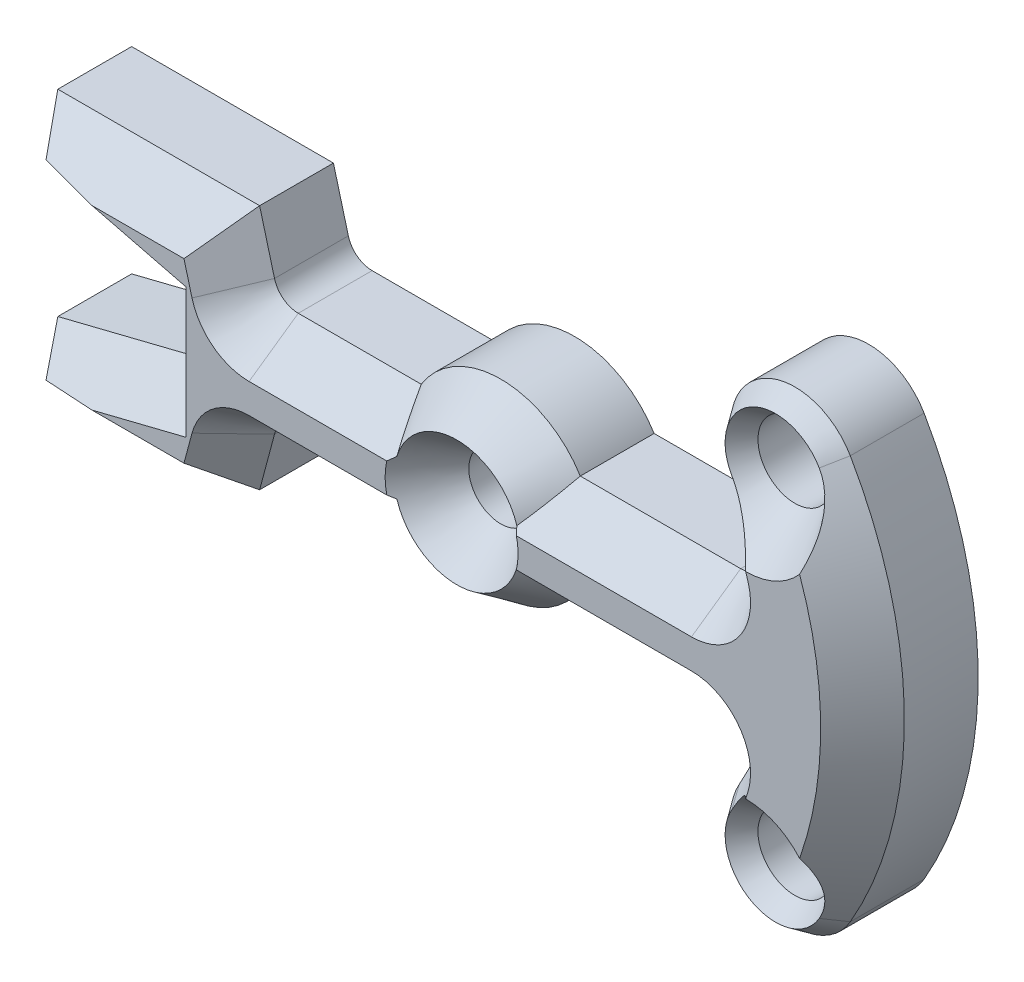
ISO-10303-21;
HEADER;
FILE_DESCRIPTION(('STEP AP214'),'2;1');
FILE_NAME('part.step','',(''),(''),'','','');
FILE_SCHEMA(('AUTOMOTIVE_DESIGN { 1 0 10303 214 1 1 1 1 }'));
ENDSEC;
DATA;
#1=APPLICATION_CONTEXT('core data for automotive mechanical design processes');
#2=APPLICATION_PROTOCOL_DEFINITION('international standard','automotive_design',2000,#1);
#3=PRODUCT_CONTEXT('',#1,'mechanical');
#4=PRODUCT('Part','Part','',(#3));
#5=PRODUCT_RELATED_PRODUCT_CATEGORY('part','',(#4));
#6=PRODUCT_DEFINITION_FORMATION('','',#4);
#7=PRODUCT_DEFINITION_CONTEXT('part definition',#1,'design');
#8=PRODUCT_DEFINITION('design','',#6,#7);
#9=PRODUCT_DEFINITION_SHAPE('','',#8);
#10=(LENGTH_UNIT() NAMED_UNIT(*) SI_UNIT(.MILLI.,.METRE.));
#11=(NAMED_UNIT(*) PLANE_ANGLE_UNIT() SI_UNIT($,.RADIAN.));
#12=(NAMED_UNIT(*) SI_UNIT($,.STERADIAN.) SOLID_ANGLE_UNIT());
#13=UNCERTAINTY_MEASURE_WITH_UNIT(LENGTH_MEASURE(1.E-05),#10,'distance_accuracy_value','');
#14=(GEOMETRIC_REPRESENTATION_CONTEXT(3) GLOBAL_UNCERTAINTY_ASSIGNED_CONTEXT((#13)) GLOBAL_UNIT_ASSIGNED_CONTEXT((#10,
#11,#12)) REPRESENTATION_CONTEXT('',''));
#15=CARTESIAN_POINT('',(0.,0.,0.));
#16=DIRECTION('',(0.,0.,1.));
#17=DIRECTION('',(1.,0.,0.));
#18=AXIS2_PLACEMENT_3D('',#15,#16,#17);
#19=CARTESIAN_POINT('',(59.755752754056,-34.5000000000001,-15.));
#20=DIRECTION('',(0.,0.,1.));
#21=DIRECTION('',(1.,0.,0.));
#22=AXIS2_PLACEMENT_3D('',#19,#20,#21);
#23=CYLINDRICAL_SURFACE('',#22,13.);
#24=CARTESIAN_POINT('',(59.755752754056,-34.5000000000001,0.));
#25=DIRECTION('',(0.,0.,1.));
#26=DIRECTION('',(1.,0.,0.));
#27=AXIS2_PLACEMENT_3D('',#24,#25,#26);
#28=CIRCLE('',#27,13.);
#29=CARTESIAN_POINT('',(48.4974225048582,-28.0000000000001,0.));
#30=VERTEX_POINT('',#29);
#31=CARTESIAN_POINT('',(71.0140830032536,-41.0000000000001,0.));
#32=VERTEX_POINT('',#31);
#33=EDGE_CURVE('E226',#30,#32,#28,.T.);
#34=ORIENTED_EDGE('',*,*,#33,.F.);
#35=DIRECTION('',(0.,0.,1.));
#36=VECTOR('',#35,1.);
#37=CARTESIAN_POINT('',(48.4974225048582,-28.0000000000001,-15.));
#38=LINE('',#37,#36);
#39=CARTESIAN_POINT('',(48.4974225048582,-28.0000000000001,-15.));
#40=VERTEX_POINT('',#39);
#41=EDGE_CURVE('E11',#40,#30,#38,.T.);
#42=ORIENTED_EDGE('',*,*,#41,.F.);
#43=CARTESIAN_POINT('',(59.755752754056,-34.5000000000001,-15.));
#44=DIRECTION('',(0.,0.,1.));
#45=DIRECTION('',(1.,0.,0.));
#46=AXIS2_PLACEMENT_3D('',#43,#44,#45);
#47=CIRCLE('',#46,13.);
#48=CARTESIAN_POINT('',(71.0140830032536,-41.0000000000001,-15.));
#49=VERTEX_POINT('',#48);
#50=EDGE_CURVE('E295',#40,#49,#47,.T.);
#51=ORIENTED_EDGE('',*,*,#50,.T.);
#52=DIRECTION('',(0.,0.,1.));
#53=VECTOR('',#52,1.);
#54=CARTESIAN_POINT('',(71.0140830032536,-41.0000000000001,-15.));
#55=LINE('',#54,#53);
#56=EDGE_CURVE('E36',#49,#32,#55,.T.);
#57=ORIENTED_EDGE('',*,*,#56,.T.);
#58=EDGE_LOOP('',(#34,#42,#51,#57));
#59=FACE_BOUND('',#58,.T.);
#60=ADVANCED_FACE('F33',(#59),#23,.T.);
#61=CARTESIAN_POINT('',(-1.07070289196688E-07,0.,-15.));
#62=DIRECTION('',(0.,0.,1.));
#63=DIRECTION('',(1.,0.,0.));
#64=AXIS2_PLACEMENT_3D('',#61,#62,#63);
#65=CYLINDRICAL_SURFACE('',#64,56.);
#66=CARTESIAN_POINT('',(-1.07070289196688E-07,0.,0.));
#67=DIRECTION('',(0.,0.,-1.));
#68=DIRECTION('',(1.,0.,0.));
#69=AXIS2_PLACEMENT_3D('',#66,#67,#68);
#70=CIRCLE('',#69,56.);
#71=CARTESIAN_POINT('',(53.5230764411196,-16.4705882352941,0.));
#72=VERTEX_POINT('',#71);
#73=EDGE_CURVE('E293',#72,#30,#70,.T.);
#74=ORIENTED_EDGE('',*,*,#73,.F.);
#75=DIRECTION('',(0.,0.,1.));
#76=VECTOR('',#75,1.);
#77=CARTESIAN_POINT('',(53.5230764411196,-16.4705882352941,-15.));
#78=LINE('',#77,#76);
#79=CARTESIAN_POINT('',(53.5230764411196,-16.4705882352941,-15.));
#80=VERTEX_POINT('',#79);
#81=EDGE_CURVE('E42',#80,#72,#78,.T.);
#82=ORIENTED_EDGE('',*,*,#81,.F.);
#83=CARTESIAN_POINT('',(-1.07070289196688E-07,0.,-15.));
#84=DIRECTION('',(0.,0.,-1.));
#85=DIRECTION('',(1.,0.,0.));
#86=AXIS2_PLACEMENT_3D('',#83,#84,#85);
#87=CIRCLE('',#86,56.);
#88=EDGE_CURVE('E216',#80,#40,#87,.T.);
#89=ORIENTED_EDGE('',*,*,#88,.T.);
#90=ORIENTED_EDGE('',*,*,#41,.T.);
#91=EDGE_LOOP('',(#74,#82,#89,#90));
#92=FACE_BOUND('',#91,.T.);
#93=ADVANCED_FACE('F372',(#92),#65,.F.);
#94=CARTESIAN_POINT('',(48.7442303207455,-15.,-15.));
#95=DIRECTION('',(0.,0.,1.));
#96=DIRECTION('',(1.,0.,0.));
#97=AXIS2_PLACEMENT_3D('',#94,#95,#96);
#98=CYLINDRICAL_SURFACE('',#97,5.);
#99=CARTESIAN_POINT('',(48.7442303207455,-15.,0.));
#100=DIRECTION('',(0.,0.,-1.));
#101=DIRECTION('',(1.,0.,0.));
#102=AXIS2_PLACEMENT_3D('',#99,#100,#101);
#103=CIRCLE('',#102,5.);
#104=CARTESIAN_POINT('',(48.7442303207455,-10.,0.));
#105=VERTEX_POINT('',#104);
#106=EDGE_CURVE('E205',#105,#72,#103,.T.);
#107=ORIENTED_EDGE('',*,*,#106,.F.);
#108=DIRECTION('',(0.,0.,1.));
#109=VECTOR('',#108,1.);
#110=CARTESIAN_POINT('',(48.7442303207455,-10.,-15.));
#111=LINE('',#110,#109);
#112=CARTESIAN_POINT('',(48.7442303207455,-10.,-15.));
#113=VERTEX_POINT('',#112);
#114=EDGE_CURVE('E125',#113,#105,#111,.T.);
#115=ORIENTED_EDGE('',*,*,#114,.F.);
#116=CARTESIAN_POINT('',(48.7442303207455,-15.,-15.));
#117=DIRECTION('',(0.,0.,-1.));
#118=DIRECTION('',(1.,0.,0.));
#119=AXIS2_PLACEMENT_3D('',#116,#117,#118);
#120=CIRCLE('',#119,5.);
#121=EDGE_CURVE('E202',#113,#80,#120,.T.);
#122=ORIENTED_EDGE('',*,*,#121,.T.);
#123=ORIENTED_EDGE('',*,*,#81,.T.);
#124=EDGE_LOOP('',(#107,#115,#122,#123));
#125=FACE_BOUND('',#124,.T.);
#126=ADVANCED_FACE('F201',(#125),#98,.F.);
#127=CARTESIAN_POINT('',(16.1554944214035,-10.,-15.));
#128=DIRECTION('',(0.,-1.,0.));
#129=DIRECTION('',(0.,0.,-1.));
#130=AXIS2_PLACEMENT_3D('',#127,#128,#129);
#131=PLANE('',#130);
#132=DIRECTION('',(1.,0.,0.));
#133=VECTOR('',#132,1.);
#134=CARTESIAN_POINT('',(16.1554944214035,-10.,0.));
#135=LINE('',#134,#133);
#136=CARTESIAN_POINT('',(16.1554944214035,-10.,0.));
#137=VERTEX_POINT('',#136);
#138=EDGE_CURVE('E290',#137,#105,#135,.T.);
#139=ORIENTED_EDGE('',*,*,#138,.F.);
#140=DIRECTION('',(0.,0.,1.));
#141=VECTOR('',#140,1.);
#142=CARTESIAN_POINT('',(16.1554944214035,-10.,-15.));
#143=LINE('',#142,#141);
#144=CARTESIAN_POINT('',(16.1554944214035,-10.,-15.));
#145=VERTEX_POINT('',#144);
#146=EDGE_CURVE('E207',#145,#137,#143,.T.);
#147=ORIENTED_EDGE('',*,*,#146,.F.);
#148=DIRECTION('',(1.,0.,0.));
#149=VECTOR('',#148,1.);
#150=CARTESIAN_POINT('',(16.1554944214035,-10.,-15.));
#151=LINE('',#150,#149);
#152=EDGE_CURVE('E213',#145,#113,#151,.T.);
#153=ORIENTED_EDGE('',*,*,#152,.T.);
#154=ORIENTED_EDGE('',*,*,#114,.T.);
#155=EDGE_LOOP('',(#139,#147,#153,#154));
#156=FACE_BOUND('',#155,.T.);
#157=ADVANCED_FACE('F218',(#156),#131,.T.);
#158=CARTESIAN_POINT('',(0.,0.,-15.));
#159=DIRECTION('',(0.,0.,1.));
#160=DIRECTION('',(1.,0.,0.));
#161=AXIS2_PLACEMENT_3D('',#158,#159,#160);
#162=CYLINDRICAL_SURFACE('',#161,19.);
#163=CARTESIAN_POINT('',(0.,0.,0.));
#164=DIRECTION('',(0.,0.,1.));
#165=DIRECTION('',(1.,0.,0.));
#166=AXIS2_PLACEMENT_3D('',#163,#164,#165);
#167=CIRCLE('',#166,19.);
#168=CARTESIAN_POINT('',(-16.1554944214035,-10.,0.));
#169=VERTEX_POINT('',#168);
#170=EDGE_CURVE('E287',#169,#137,#167,.T.);
#171=ORIENTED_EDGE('',*,*,#170,.F.);
#172=DIRECTION('',(0.,0.,1.));
#173=VECTOR('',#172,1.);
#174=CARTESIAN_POINT('',(-16.1554944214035,-10.,-15.));
#175=LINE('',#174,#173);
#176=CARTESIAN_POINT('',(-16.1554944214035,-10.,-15.));
#177=VERTEX_POINT('',#176);
#178=EDGE_CURVE('E299',#177,#169,#175,.T.);
#179=ORIENTED_EDGE('',*,*,#178,.F.);
#180=CARTESIAN_POINT('',(0.,0.,-15.));
#181=DIRECTION('',(0.,0.,1.));
#182=DIRECTION('',(1.,0.,0.));
#183=AXIS2_PLACEMENT_3D('',#180,#181,#182);
#184=CIRCLE('',#183,19.);
#185=EDGE_CURVE('E219',#177,#145,#184,.T.);
#186=ORIENTED_EDGE('',*,*,#185,.T.);
#187=ORIENTED_EDGE('',*,*,#146,.T.);
#188=EDGE_LOOP('',(#171,#179,#186,#187));
#189=FACE_BOUND('',#188,.T.);
#190=ADVANCED_FACE('F860',(#189),#162,.T.);
#191=CARTESIAN_POINT('',(-41.1441272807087,-10.,-15.));
#192=DIRECTION('',(0.,-1.,0.));
#193=DIRECTION('',(0.,0.,-1.));
#194=AXIS2_PLACEMENT_3D('',#191,#192,#193);
#195=PLANE('',#194);
#196=DIRECTION('',(1.,0.,0.));
#197=VECTOR('',#196,1.);
#198=CARTESIAN_POINT('',(-41.1441272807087,-10.,0.));
#199=LINE('',#198,#197);
#200=CARTESIAN_POINT('',(-41.1441272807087,-10.,0.));
#201=VERTEX_POINT('',#200);
#202=EDGE_CURVE('E284',#201,#169,#199,.T.);
#203=ORIENTED_EDGE('',*,*,#202,.F.);
#204=DIRECTION('',(0.,0.,1.));
#205=VECTOR('',#204,1.);
#206=CARTESIAN_POINT('',(-41.1441272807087,-10.,-15.));
#207=LINE('',#206,#205);
#208=CARTESIAN_POINT('',(-41.1441272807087,-10.,-15.));
#209=VERTEX_POINT('',#208);
#210=EDGE_CURVE('E301',#209,#201,#207,.T.);
#211=ORIENTED_EDGE('',*,*,#210,.F.);
#212=DIRECTION('',(1.,0.,0.));
#213=VECTOR('',#212,1.);
#214=CARTESIAN_POINT('',(-41.1441272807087,-10.,-15.));
#215=LINE('',#214,#213);
#216=EDGE_CURVE('E221',#209,#177,#215,.T.);
#217=ORIENTED_EDGE('',*,*,#216,.T.);
#218=ORIENTED_EDGE('',*,*,#178,.T.);
#219=EDGE_LOOP('',(#203,#211,#217,#218));
#220=FACE_BOUND('',#219,.T.);
#221=ADVANCED_FACE('F689',(#220),#195,.T.);
#222=CARTESIAN_POINT('',(-41.1441272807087,-15.,-15.));
#223=DIRECTION('',(0.,0.,1.));
#224=DIRECTION('',(1.,0.,0.));
#225=AXIS2_PLACEMENT_3D('',#222,#223,#224);
#226=CYLINDRICAL_SURFACE('',#225,5.);
#227=CARTESIAN_POINT('',(-41.1441272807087,-15.,0.));
#228=DIRECTION('',(0.,0.,-1.));
#229=DIRECTION('',(1.,0.,0.));
#230=AXIS2_PLACEMENT_3D('',#227,#228,#229);
#231=CIRCLE('',#230,5.);
#232=CARTESIAN_POINT('',(-45.973756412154,-13.7059047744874,0.));
#233=VERTEX_POINT('',#232);
#234=EDGE_CURVE('E281',#233,#201,#231,.T.);
#235=ORIENTED_EDGE('',*,*,#234,.F.);
#236=DIRECTION('',(0.,0.,1.));
#237=VECTOR('',#236,1.);
#238=CARTESIAN_POINT('',(-45.973756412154,-13.7059047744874,-15.));
#239=LINE('',#238,#237);
#240=CARTESIAN_POINT('',(-45.973756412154,-13.7059047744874,-15.));
#241=VERTEX_POINT('',#240);
#242=EDGE_CURVE('E303',#241,#233,#239,.T.);
#243=ORIENTED_EDGE('',*,*,#242,.F.);
#244=CARTESIAN_POINT('',(-41.1441272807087,-15.,-15.));
#245=DIRECTION('',(0.,0.,-1.));
#246=DIRECTION('',(1.,0.,0.));
#247=AXIS2_PLACEMENT_3D('',#244,#245,#246);
#248=CIRCLE('',#247,5.);
#249=EDGE_CURVE('E683',#241,#209,#248,.T.);
#250=ORIENTED_EDGE('',*,*,#249,.T.);
#251=ORIENTED_EDGE('',*,*,#210,.T.);
#252=EDGE_LOOP('',(#235,#243,#250,#251));
#253=FACE_BOUND('',#252,.T.);
#254=ADVANCED_FACE('F695',(#253),#226,.F.);
#255=CARTESIAN_POINT('',(-49.0000001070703,-25.,-15.));
#256=DIRECTION('',(0.965925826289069,-0.258819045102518,0.));
#257=DIRECTION('',(0.258819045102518,0.965925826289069,0.));
#258=AXIS2_PLACEMENT_3D('',#255,#256,#257);
#259=PLANE('',#258);
#260=DIRECTION('',(0.258819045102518,0.965925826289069,0.));
#261=VECTOR('',#260,1.);
#262=CARTESIAN_POINT('',(-49.0000001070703,-25.,0.));
#263=LINE('',#262,#261);
#264=CARTESIAN_POINT('',(-49.0000001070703,-25.,0.));
#265=VERTEX_POINT('',#264);
#266=EDGE_CURVE('E278',#265,#233,#263,.T.);
#267=ORIENTED_EDGE('',*,*,#266,.F.);
#268=DIRECTION('',(0.,0.,1.));
#269=VECTOR('',#268,1.);
#270=CARTESIAN_POINT('',(-49.0000001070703,-25.,-15.));
#271=LINE('',#270,#269);
#272=CARTESIAN_POINT('',(-49.0000001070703,-25.,-15.));
#273=VERTEX_POINT('',#272);
#274=EDGE_CURVE('E305',#273,#265,#271,.T.);
#275=ORIENTED_EDGE('',*,*,#274,.F.);
#276=DIRECTION('',(0.258819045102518,0.965925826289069,0.));
#277=VECTOR('',#276,1.);
#278=CARTESIAN_POINT('',(-49.0000001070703,-25.,-15.));
#279=LINE('',#278,#277);
#280=EDGE_CURVE('E680',#273,#241,#279,.T.);
#281=ORIENTED_EDGE('',*,*,#280,.T.);
#282=ORIENTED_EDGE('',*,*,#242,.T.);
#283=EDGE_LOOP('',(#267,#275,#281,#282));
#284=FACE_BOUND('',#283,.T.);
#285=ADVANCED_FACE('F698',(#284),#259,.T.);
#286=CARTESIAN_POINT('',(-90.0000001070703,-25.,-15.));
#287=DIRECTION('',(0.,-1.,0.));
#288=DIRECTION('',(0.,0.,-1.));
#289=AXIS2_PLACEMENT_3D('',#286,#287,#288);
#290=PLANE('',#289);
#291=DIRECTION('',(1.,0.,0.));
#292=VECTOR('',#291,1.);
#293=CARTESIAN_POINT('',(-90.0000001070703,-25.,0.));
#294=LINE('',#293,#292);
#295=CARTESIAN_POINT('',(-90.0000001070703,-25.,0.));
#296=VERTEX_POINT('',#295);
#297=EDGE_CURVE('E275',#296,#265,#294,.T.);
#298=ORIENTED_EDGE('',*,*,#297,.F.);
#299=DIRECTION('',(0.,0.,1.));
#300=VECTOR('',#299,1.);
#301=CARTESIAN_POINT('',(-90.0000001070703,-25.,-15.));
#302=LINE('',#301,#300);
#303=CARTESIAN_POINT('',(-90.0000001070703,-25.,-15.));
#304=VERTEX_POINT('',#303);
#305=EDGE_CURVE('E307',#304,#296,#302,.T.);
#306=ORIENTED_EDGE('',*,*,#305,.F.);
#307=DIRECTION('',(1.,0.,0.));
#308=VECTOR('',#307,1.);
#309=CARTESIAN_POINT('',(-90.0000001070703,-25.,-15.));
#310=LINE('',#309,#308);
#311=EDGE_CURVE('E677',#304,#273,#310,.T.);
#312=ORIENTED_EDGE('',*,*,#311,.T.);
#313=ORIENTED_EDGE('',*,*,#274,.T.);
#314=EDGE_LOOP('',(#298,#306,#312,#313));
#315=FACE_BOUND('',#314,.T.);
#316=ADVANCED_FACE('F703',(#315),#290,.T.);
#317=CARTESIAN_POINT('',(-90.0000001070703,-15.,-15.));
#318=DIRECTION('',(-1.,0.,0.));
#319=DIRECTION('',(0.,0.,1.));
#320=AXIS2_PLACEMENT_3D('',#317,#318,#319);
#321=PLANE('',#320);
#322=DIRECTION('',(0.,-1.,0.));
#323=VECTOR('',#322,1.);
#324=CARTESIAN_POINT('',(-90.0000001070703,-15.,0.));
#325=LINE('',#324,#323);
#326=CARTESIAN_POINT('',(-90.0000001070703,-15.,0.));
#327=VERTEX_POINT('',#326);
#328=EDGE_CURVE('E272',#327,#296,#325,.T.);
#329=ORIENTED_EDGE('',*,*,#328,.F.);
#330=DIRECTION('',(0.,0.,1.));
#331=VECTOR('',#330,1.);
#332=CARTESIAN_POINT('',(-90.0000001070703,-15.,-15.));
#333=LINE('',#332,#331);
#334=CARTESIAN_POINT('',(-90.0000001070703,-15.,-15.));
#335=VERTEX_POINT('',#334);
#336=EDGE_CURVE('E309',#335,#327,#333,.T.);
#337=ORIENTED_EDGE('',*,*,#336,.F.);
#338=DIRECTION('',(0.,-1.,0.));
#339=VECTOR('',#338,1.);
#340=CARTESIAN_POINT('',(-90.0000001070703,-15.,-15.));
#341=LINE('',#340,#339);
#342=EDGE_CURVE('E674',#335,#304,#341,.T.);
#343=ORIENTED_EDGE('',*,*,#342,.T.);
#344=ORIENTED_EDGE('',*,*,#305,.T.);
#345=EDGE_LOOP('',(#329,#337,#343,#344));
#346=FACE_BOUND('',#345,.T.);
#347=ADVANCED_FACE('F706',(#346),#321,.T.);
#348=CARTESIAN_POINT('',(-61.0000001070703,-7.76948791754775,-15.));
#349=DIRECTION('',(-0.241921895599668,0.970295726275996,0.));
#350=DIRECTION('',(-0.970295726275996,-0.241921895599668,0.));
#351=AXIS2_PLACEMENT_3D('',#348,#349,#350);
#352=PLANE('',#351);
#353=DIRECTION('',(-0.970295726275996,-0.241921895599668,0.));
#354=VECTOR('',#353,1.);
#355=CARTESIAN_POINT('',(-61.0000001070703,-7.76948791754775,0.));
#356=LINE('',#355,#354);
#357=CARTESIAN_POINT('',(-61.0000001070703,-7.76948791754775,0.));
#358=VERTEX_POINT('',#357);
#359=EDGE_CURVE('E269',#358,#327,#356,.T.);
#360=ORIENTED_EDGE('',*,*,#359,.F.);
#361=DIRECTION('',(0.,0.,1.));
#362=VECTOR('',#361,1.);
#363=CARTESIAN_POINT('',(-61.0000001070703,-7.76948791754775,-15.));
#364=LINE('',#363,#362);
#365=CARTESIAN_POINT('',(-61.0000001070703,-7.76948791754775,-15.));
#366=VERTEX_POINT('',#365);
#367=EDGE_CURVE('E311',#366,#358,#364,.T.);
#368=ORIENTED_EDGE('',*,*,#367,.F.);
#369=DIRECTION('',(-0.970295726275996,-0.241921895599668,0.));
#370=VECTOR('',#369,1.);
#371=CARTESIAN_POINT('',(-61.0000001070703,-7.76948791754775,-15.));
#372=LINE('',#371,#370);
#373=EDGE_CURVE('E671',#366,#335,#372,.T.);
#374=ORIENTED_EDGE('',*,*,#373,.T.);
#375=ORIENTED_EDGE('',*,*,#336,.T.);
#376=EDGE_LOOP('',(#360,#368,#374,#375));
#377=FACE_BOUND('',#376,.T.);
#378=ADVANCED_FACE('F712',(#377),#352,.T.);
#379=CARTESIAN_POINT('',(-61.0000001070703,-7.76948791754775,-15.));
#380=DIRECTION('',(-1.,0.,0.));
#381=DIRECTION('',(0.,0.,1.));
#382=AXIS2_PLACEMENT_3D('',#379,#380,#381);
#383=PLANE('',#382);
#384=DIRECTION('',(0.,-1.,0.));
#385=VECTOR('',#384,1.);
#386=CARTESIAN_POINT('',(-61.0000001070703,-7.76948791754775,0.));
#387=LINE('',#386,#385);
#388=CARTESIAN_POINT('',(-61.0000001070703,7.76948791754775,0.));
#389=VERTEX_POINT('',#388);
#390=EDGE_CURVE('E266',#389,#358,#387,.T.);
#391=ORIENTED_EDGE('',*,*,#390,.F.);
#392=DIRECTION('',(0.,0.,1.));
#393=VECTOR('',#392,1.);
#394=CARTESIAN_POINT('',(-61.0000001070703,7.76948791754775,-15.));
#395=LINE('',#394,#393);
#396=CARTESIAN_POINT('',(-61.0000001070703,7.76948791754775,-15.));
#397=VERTEX_POINT('',#396);
#398=EDGE_CURVE('E313',#397,#389,#395,.T.);
#399=ORIENTED_EDGE('',*,*,#398,.F.);
#400=DIRECTION('',(0.,-1.,0.));
#401=VECTOR('',#400,1.);
#402=CARTESIAN_POINT('',(-61.0000001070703,-7.76948791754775,-15.));
#403=LINE('',#402,#401);
#404=EDGE_CURVE('E668',#397,#366,#403,.T.);
#405=ORIENTED_EDGE('',*,*,#404,.T.);
#406=ORIENTED_EDGE('',*,*,#367,.T.);
#407=EDGE_LOOP('',(#391,#399,#405,#406));
#408=FACE_BOUND('',#407,.T.);
#409=ADVANCED_FACE('F715',(#408),#383,.T.);
#410=CARTESIAN_POINT('',(-61.0000001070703,7.76948791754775,-15.));
#411=DIRECTION('',(-0.241921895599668,-0.970295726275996,0.));
#412=DIRECTION('',(0.970295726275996,-0.241921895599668,0.));
#413=AXIS2_PLACEMENT_3D('',#410,#411,#412);
#414=PLANE('',#413);
#415=DIRECTION('',(0.970295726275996,-0.241921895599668,0.));
#416=VECTOR('',#415,1.);
#417=CARTESIAN_POINT('',(-61.0000001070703,7.76948791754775,0.));
#418=LINE('',#417,#416);
#419=CARTESIAN_POINT('',(-90.0000001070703,15.,0.));
#420=VERTEX_POINT('',#419);
#421=EDGE_CURVE('E263',#420,#389,#418,.T.);
#422=ORIENTED_EDGE('',*,*,#421,.F.);
#423=DIRECTION('',(0.,0.,1.));
#424=VECTOR('',#423,1.);
#425=CARTESIAN_POINT('',(-90.0000001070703,15.,-15.));
#426=LINE('',#425,#424);
#427=CARTESIAN_POINT('',(-90.0000001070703,15.,-15.));
#428=VERTEX_POINT('',#427);
#429=EDGE_CURVE('E315',#428,#420,#426,.T.);
#430=ORIENTED_EDGE('',*,*,#429,.F.);
#431=DIRECTION('',(0.970295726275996,-0.241921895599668,0.));
#432=VECTOR('',#431,1.);
#433=CARTESIAN_POINT('',(-61.0000001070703,7.76948791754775,-15.));
#434=LINE('',#433,#432);
#435=EDGE_CURVE('E665',#428,#397,#434,.T.);
#436=ORIENTED_EDGE('',*,*,#435,.T.);
#437=ORIENTED_EDGE('',*,*,#398,.T.);
#438=EDGE_LOOP('',(#422,#430,#436,#437));
#439=FACE_BOUND('',#438,.T.);
#440=ADVANCED_FACE('F720',(#439),#414,.T.);
#441=CARTESIAN_POINT('',(-90.0000001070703,15.,-15.));
#442=DIRECTION('',(-1.,0.,0.));
#443=DIRECTION('',(0.,0.,1.));
#444=AXIS2_PLACEMENT_3D('',#441,#442,#443);
#445=PLANE('',#444);
#446=DIRECTION('',(0.,-1.,0.));
#447=VECTOR('',#446,1.);
#448=CARTESIAN_POINT('',(-90.0000001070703,15.,0.));
#449=LINE('',#448,#447);
#450=CARTESIAN_POINT('',(-90.0000001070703,25.,0.));
#451=VERTEX_POINT('',#450);
#452=EDGE_CURVE('E260',#451,#420,#449,.T.);
#453=ORIENTED_EDGE('',*,*,#452,.F.);
#454=DIRECTION('',(0.,0.,1.));
#455=VECTOR('',#454,1.);
#456=CARTESIAN_POINT('',(-90.0000001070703,25.,-15.));
#457=LINE('',#456,#455);
#458=CARTESIAN_POINT('',(-90.0000001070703,25.,-15.));
#459=VERTEX_POINT('',#458);
#460=EDGE_CURVE('E317',#459,#451,#457,.T.);
#461=ORIENTED_EDGE('',*,*,#460,.F.);
#462=DIRECTION('',(0.,-1.,0.));
#463=VECTOR('',#462,1.);
#464=CARTESIAN_POINT('',(-90.0000001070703,15.,-15.));
#465=LINE('',#464,#463);
#466=EDGE_CURVE('E662',#459,#428,#465,.T.);
#467=ORIENTED_EDGE('',*,*,#466,.T.);
#468=ORIENTED_EDGE('',*,*,#429,.T.);
#469=EDGE_LOOP('',(#453,#461,#467,#468));
#470=FACE_BOUND('',#469,.T.);
#471=ADVANCED_FACE('F723',(#470),#445,.T.);
#472=CARTESIAN_POINT('',(-90.0000001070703,25.,-15.));
#473=DIRECTION('',(0.,1.,0.));
#474=DIRECTION('',(0.,0.,1.));
#475=AXIS2_PLACEMENT_3D('',#472,#473,#474);
#476=PLANE('',#475);
#477=DIRECTION('',(-1.,0.,0.));
#478=VECTOR('',#477,1.);
#479=CARTESIAN_POINT('',(-90.0000001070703,25.,0.));
#480=LINE('',#479,#478);
#481=CARTESIAN_POINT('',(-49.0000001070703,25.,0.));
#482=VERTEX_POINT('',#481);
#483=EDGE_CURVE('E257',#482,#451,#480,.T.);
#484=ORIENTED_EDGE('',*,*,#483,.F.);
#485=DIRECTION('',(0.,0.,1.));
#486=VECTOR('',#485,1.);
#487=CARTESIAN_POINT('',(-49.0000001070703,25.,-15.));
#488=LINE('',#487,#486);
#489=CARTESIAN_POINT('',(-49.0000001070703,25.,-15.));
#490=VERTEX_POINT('',#489);
#491=EDGE_CURVE('E319',#490,#482,#488,.T.);
#492=ORIENTED_EDGE('',*,*,#491,.F.);
#493=DIRECTION('',(-1.,0.,0.));
#494=VECTOR('',#493,1.);
#495=CARTESIAN_POINT('',(-90.0000001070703,25.,-15.));
#496=LINE('',#495,#494);
#497=EDGE_CURVE('E659',#490,#459,#496,.T.);
#498=ORIENTED_EDGE('',*,*,#497,.T.);
#499=ORIENTED_EDGE('',*,*,#460,.T.);
#500=EDGE_LOOP('',(#484,#492,#498,#499));
#501=FACE_BOUND('',#500,.T.);
#502=ADVANCED_FACE('F729',(#501),#476,.T.);
#503=CARTESIAN_POINT('',(-49.0000001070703,25.,-15.));
#504=DIRECTION('',(0.965925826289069,0.258819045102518,0.));
#505=DIRECTION('',(-0.258819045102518,0.965925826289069,0.));
#506=AXIS2_PLACEMENT_3D('',#503,#504,#505);
#507=PLANE('',#506);
#508=DIRECTION('',(-0.258819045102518,0.965925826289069,0.));
#509=VECTOR('',#508,1.);
#510=CARTESIAN_POINT('',(-49.0000001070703,25.,0.));
#511=LINE('',#510,#509);
#512=CARTESIAN_POINT('',(-45.973756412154,13.7059047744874,0.));
#513=VERTEX_POINT('',#512);
#514=EDGE_CURVE('E254',#513,#482,#511,.T.);
#515=ORIENTED_EDGE('',*,*,#514,.F.);
#516=DIRECTION('',(0.,0.,1.));
#517=VECTOR('',#516,1.);
#518=CARTESIAN_POINT('',(-45.973756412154,13.7059047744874,-15.));
#519=LINE('',#518,#517);
#520=CARTESIAN_POINT('',(-45.973756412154,13.7059047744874,-15.));
#521=VERTEX_POINT('',#520);
#522=EDGE_CURVE('E321',#521,#513,#519,.T.);
#523=ORIENTED_EDGE('',*,*,#522,.F.);
#524=DIRECTION('',(-0.258819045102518,0.965925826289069,0.));
#525=VECTOR('',#524,1.);
#526=CARTESIAN_POINT('',(-49.0000001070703,25.,-15.));
#527=LINE('',#526,#525);
#528=EDGE_CURVE('E656',#521,#490,#527,.T.);
#529=ORIENTED_EDGE('',*,*,#528,.T.);
#530=ORIENTED_EDGE('',*,*,#491,.T.);
#531=EDGE_LOOP('',(#515,#523,#529,#530));
#532=FACE_BOUND('',#531,.T.);
#533=ADVANCED_FACE('F732',(#532),#507,.T.);
#534=CARTESIAN_POINT('',(-41.1441272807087,15.,-15.));
#535=DIRECTION('',(0.,0.,1.));
#536=DIRECTION('',(1.,0.,0.));
#537=AXIS2_PLACEMENT_3D('',#534,#535,#536);
#538=CYLINDRICAL_SURFACE('',#537,5.);
#539=CARTESIAN_POINT('',(-41.1441272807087,15.,0.));
#540=DIRECTION('',(0.,0.,-1.));
#541=DIRECTION('',(-1.,0.,0.));
#542=AXIS2_PLACEMENT_3D('',#539,#540,#541);
#543=CIRCLE('',#542,5.);
#544=CARTESIAN_POINT('',(-41.1441272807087,10.,0.));
#545=VERTEX_POINT('',#544);
#546=EDGE_CURVE('E251',#545,#513,#543,.T.);
#547=ORIENTED_EDGE('',*,*,#546,.F.);
#548=DIRECTION('',(0.,0.,1.));
#549=VECTOR('',#548,1.);
#550=CARTESIAN_POINT('',(-41.1441272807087,10.,-15.));
#551=LINE('',#550,#549);
#552=CARTESIAN_POINT('',(-41.1441272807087,10.,-15.));
#553=VERTEX_POINT('',#552);
#554=EDGE_CURVE('E323',#553,#545,#551,.T.);
#555=ORIENTED_EDGE('',*,*,#554,.F.);
#556=CARTESIAN_POINT('',(-41.1441272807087,15.,-15.));
#557=DIRECTION('',(0.,0.,-1.));
#558=DIRECTION('',(-1.,0.,0.));
#559=AXIS2_PLACEMENT_3D('',#556,#557,#558);
#560=CIRCLE('',#559,5.);
#561=EDGE_CURVE('E653',#553,#521,#560,.T.);
#562=ORIENTED_EDGE('',*,*,#561,.T.);
#563=ORIENTED_EDGE('',*,*,#522,.T.);
#564=EDGE_LOOP('',(#547,#555,#562,#563));
#565=FACE_BOUND('',#564,.T.);
#566=ADVANCED_FACE('F737',(#565),#538,.F.);
#567=CARTESIAN_POINT('',(-41.1441272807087,10.,-15.));
#568=DIRECTION('',(0.,1.,0.));
#569=DIRECTION('',(0.,0.,1.));
#570=AXIS2_PLACEMENT_3D('',#567,#568,#569);
#571=PLANE('',#570);
#572=DIRECTION('',(-1.,0.,0.));
#573=VECTOR('',#572,1.);
#574=CARTESIAN_POINT('',(-41.1441272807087,10.,0.));
#575=LINE('',#574,#573);
#576=CARTESIAN_POINT('',(-16.1554944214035,10.,0.));
#577=VERTEX_POINT('',#576);
#578=EDGE_CURVE('E248',#577,#545,#575,.T.);
#579=ORIENTED_EDGE('',*,*,#578,.F.);
#580=DIRECTION('',(0.,0.,1.));
#581=VECTOR('',#580,1.);
#582=CARTESIAN_POINT('',(-16.1554944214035,10.,-15.));
#583=LINE('',#582,#581);
#584=CARTESIAN_POINT('',(-16.1554944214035,10.,-15.));
#585=VERTEX_POINT('',#584);
#586=EDGE_CURVE('E325',#585,#577,#583,.T.);
#587=ORIENTED_EDGE('',*,*,#586,.F.);
#588=DIRECTION('',(-1.,0.,0.));
#589=VECTOR('',#588,1.);
#590=CARTESIAN_POINT('',(-41.1441272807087,10.,-15.));
#591=LINE('',#590,#589);
#592=EDGE_CURVE('E650',#585,#553,#591,.T.);
#593=ORIENTED_EDGE('',*,*,#592,.T.);
#594=ORIENTED_EDGE('',*,*,#554,.T.);
#595=EDGE_LOOP('',(#579,#587,#593,#594));
#596=FACE_BOUND('',#595,.T.);
#597=ADVANCED_FACE('F739',(#596),#571,.T.);
#598=CARTESIAN_POINT('',(0.,0.,-15.));
#599=DIRECTION('',(0.,0.,1.));
#600=DIRECTION('',(1.,0.,0.));
#601=AXIS2_PLACEMENT_3D('',#598,#599,#600);
#602=CYLINDRICAL_SURFACE('',#601,19.);
#603=CARTESIAN_POINT('',(0.,0.,0.));
#604=DIRECTION('',(0.,0.,1.));
#605=DIRECTION('',(1.,0.,0.));
#606=AXIS2_PLACEMENT_3D('',#603,#604,#605);
#607=CIRCLE('',#606,19.);
#608=CARTESIAN_POINT('',(16.1554944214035,10.,0.));
#609=VERTEX_POINT('',#608);
#610=EDGE_CURVE('E245',#609,#577,#607,.T.);
#611=ORIENTED_EDGE('',*,*,#610,.F.);
#612=DIRECTION('',(0.,0.,1.));
#613=VECTOR('',#612,1.);
#614=CARTESIAN_POINT('',(16.1554944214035,10.,-15.));
#615=LINE('',#614,#613);
#616=CARTESIAN_POINT('',(16.1554944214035,10.,-15.));
#617=VERTEX_POINT('',#616);
#618=EDGE_CURVE('E327',#617,#609,#615,.T.);
#619=ORIENTED_EDGE('',*,*,#618,.F.);
#620=CARTESIAN_POINT('',(0.,0.,-15.));
#621=DIRECTION('',(0.,0.,1.));
#622=DIRECTION('',(1.,0.,0.));
#623=AXIS2_PLACEMENT_3D('',#620,#621,#622);
#624=CIRCLE('',#623,19.);
#625=EDGE_CURVE('E648',#617,#585,#624,.T.);
#626=ORIENTED_EDGE('',*,*,#625,.T.);
#627=ORIENTED_EDGE('',*,*,#586,.T.);
#628=EDGE_LOOP('',(#611,#619,#626,#627));
#629=FACE_BOUND('',#628,.T.);
#630=ADVANCED_FACE('F603',(#629),#602,.T.);
#631=CARTESIAN_POINT('',(16.1554944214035,10.,-15.));
#632=DIRECTION('',(0.,1.,0.));
#633=DIRECTION('',(0.,0.,1.));
#634=AXIS2_PLACEMENT_3D('',#631,#632,#633);
#635=PLANE('',#634);
#636=DIRECTION('',(-1.,0.,0.));
#637=VECTOR('',#636,1.);
#638=CARTESIAN_POINT('',(16.1554944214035,10.,0.));
#639=LINE('',#638,#637);
#640=CARTESIAN_POINT('',(48.7442303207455,9.99999999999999,0.));
#641=VERTEX_POINT('',#640);
#642=EDGE_CURVE('E242',#641,#609,#639,.T.);
#643=ORIENTED_EDGE('',*,*,#642,.F.);
#644=DIRECTION('',(0.,0.,1.));
#645=VECTOR('',#644,1.);
#646=CARTESIAN_POINT('',(48.7442303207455,9.99999999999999,-15.));
#647=LINE('',#646,#645);
#648=CARTESIAN_POINT('',(48.7442303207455,9.99999999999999,-15.));
#649=VERTEX_POINT('',#648);
#650=EDGE_CURVE('E329',#649,#641,#647,.T.);
#651=ORIENTED_EDGE('',*,*,#650,.F.);
#652=DIRECTION('',(-1.,0.,0.));
#653=VECTOR('',#652,1.);
#654=CARTESIAN_POINT('',(16.1554944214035,10.,-15.));
#655=LINE('',#654,#653);
#656=EDGE_CURVE('E599',#649,#617,#655,.T.);
#657=ORIENTED_EDGE('',*,*,#656,.T.);
#658=ORIENTED_EDGE('',*,*,#618,.T.);
#659=EDGE_LOOP('',(#643,#651,#657,#658));
#660=FACE_BOUND('',#659,.T.);
#661=ADVANCED_FACE('F595',(#660),#635,.T.);
#662=CARTESIAN_POINT('',(48.7442303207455,15.,-15.));
#663=DIRECTION('',(0.,0.,1.));
#664=DIRECTION('',(1.,0.,0.));
#665=AXIS2_PLACEMENT_3D('',#662,#663,#664);
#666=CYLINDRICAL_SURFACE('',#665,5.);
#667=CARTESIAN_POINT('',(48.7442303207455,15.,0.));
#668=DIRECTION('',(0.,0.,-1.));
#669=DIRECTION('',(-1.,0.,0.));
#670=AXIS2_PLACEMENT_3D('',#667,#668,#669);
#671=CIRCLE('',#670,5.);
#672=CARTESIAN_POINT('',(53.5230764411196,16.4705882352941,0.));
#673=VERTEX_POINT('',#672);
#674=EDGE_CURVE('E239',#673,#641,#671,.T.);
#675=ORIENTED_EDGE('',*,*,#674,.F.);
#676=DIRECTION('',(0.,0.,1.));
#677=VECTOR('',#676,1.);
#678=CARTESIAN_POINT('',(53.5230764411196,16.4705882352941,-15.));
#679=LINE('',#678,#677);
#680=CARTESIAN_POINT('',(53.5230764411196,16.4705882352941,-15.));
#681=VERTEX_POINT('',#680);
#682=EDGE_CURVE('E331',#681,#673,#679,.T.);
#683=ORIENTED_EDGE('',*,*,#682,.F.);
#684=CARTESIAN_POINT('',(48.7442303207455,15.,-15.));
#685=DIRECTION('',(0.,0.,-1.));
#686=DIRECTION('',(-1.,0.,0.));
#687=AXIS2_PLACEMENT_3D('',#684,#685,#686);
#688=CIRCLE('',#687,5.);
#689=EDGE_CURVE('E644',#681,#649,#688,.T.);
#690=ORIENTED_EDGE('',*,*,#689,.T.);
#691=ORIENTED_EDGE('',*,*,#650,.T.);
#692=EDGE_LOOP('',(#675,#683,#690,#691));
#693=FACE_BOUND('',#692,.T.);
#694=ADVANCED_FACE('F743',(#693),#666,.F.);
#695=CARTESIAN_POINT('',(-1.07070289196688E-07,0.,-15.));
#696=DIRECTION('',(0.,0.,1.));
#697=DIRECTION('',(1.,0.,0.));
#698=AXIS2_PLACEMENT_3D('',#695,#696,#697);
#699=CYLINDRICAL_SURFACE('',#698,56.);
#700=CARTESIAN_POINT('',(-1.07070289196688E-07,0.,0.));
#701=DIRECTION('',(0.,0.,-1.));
#702=DIRECTION('',(1.,0.,0.));
#703=AXIS2_PLACEMENT_3D('',#700,#701,#702);
#704=CIRCLE('',#703,56.);
#705=CARTESIAN_POINT('',(48.4974225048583,28.0000000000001,0.));
#706=VERTEX_POINT('',#705);
#707=EDGE_CURVE('E236',#706,#673,#704,.T.);
#708=ORIENTED_EDGE('',*,*,#707,.F.);
#709=DIRECTION('',(0.,0.,1.));
#710=VECTOR('',#709,1.);
#711=CARTESIAN_POINT('',(48.4974225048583,28.0000000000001,-15.));
#712=LINE('',#711,#710);
#713=CARTESIAN_POINT('',(48.4974225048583,28.0000000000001,-15.));
#714=VERTEX_POINT('',#713);
#715=EDGE_CURVE('E333',#714,#706,#712,.T.);
#716=ORIENTED_EDGE('',*,*,#715,.F.);
#717=CARTESIAN_POINT('',(-1.07070289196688E-07,0.,-15.));
#718=DIRECTION('',(0.,0.,-1.));
#719=DIRECTION('',(1.,0.,0.));
#720=AXIS2_PLACEMENT_3D('',#717,#718,#719);
#721=CIRCLE('',#720,56.);
#722=EDGE_CURVE('E641',#714,#681,#721,.T.);
#723=ORIENTED_EDGE('',*,*,#722,.T.);
#724=ORIENTED_EDGE('',*,*,#682,.T.);
#725=EDGE_LOOP('',(#708,#716,#723,#724));
#726=FACE_BOUND('',#725,.T.);
#727=ADVANCED_FACE('F746',(#726),#699,.F.);
#728=CARTESIAN_POINT('',(59.755752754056,34.5000000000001,-15.));
#729=DIRECTION('',(0.,0.,1.));
#730=DIRECTION('',(1.,0.,0.));
#731=AXIS2_PLACEMENT_3D('',#728,#729,#730);
#732=CYLINDRICAL_SURFACE('',#731,13.);
#733=CARTESIAN_POINT('',(59.755752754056,34.5000000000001,0.));
#734=DIRECTION('',(0.,0.,1.));
#735=DIRECTION('',(1.,0.,0.));
#736=AXIS2_PLACEMENT_3D('',#733,#734,#735);
#737=CIRCLE('',#736,13.);
#738=CARTESIAN_POINT('',(71.0140830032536,41.0000000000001,0.));
#739=VERTEX_POINT('',#738);
#740=EDGE_CURVE('E233',#739,#706,#737,.T.);
#741=ORIENTED_EDGE('',*,*,#740,.F.);
#742=DIRECTION('',(0.,0.,1.));
#743=VECTOR('',#742,1.);
#744=CARTESIAN_POINT('',(71.0140830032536,41.0000000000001,-15.));
#745=LINE('',#744,#743);
#746=CARTESIAN_POINT('',(71.0140830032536,41.0000000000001,-15.));
#747=VERTEX_POINT('',#746);
#748=EDGE_CURVE('E334',#747,#739,#745,.T.);
#749=ORIENTED_EDGE('',*,*,#748,.F.);
#750=CARTESIAN_POINT('',(59.755752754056,34.5000000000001,-15.));
#751=DIRECTION('',(0.,0.,1.));
#752=DIRECTION('',(1.,0.,0.));
#753=AXIS2_PLACEMENT_3D('',#750,#751,#752);
#754=CIRCLE('',#753,13.);
#755=EDGE_CURVE('E638',#747,#714,#754,.T.);
#756=ORIENTED_EDGE('',*,*,#755,.T.);
#757=ORIENTED_EDGE('',*,*,#715,.T.);
#758=EDGE_LOOP('',(#741,#749,#756,#757));
#759=FACE_BOUND('',#758,.T.);
#760=ADVANCED_FACE('F749',(#759),#732,.T.);
#761=CARTESIAN_POINT('',(-1.07070289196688E-07,0.,-15.));
#762=DIRECTION('',(0.,0.,1.));
#763=DIRECTION('',(1.,0.,0.));
#764=AXIS2_PLACEMENT_3D('',#761,#762,#763);
#765=CYLINDRICAL_SURFACE('',#764,82.);
#766=CARTESIAN_POINT('',(-1.07070289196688E-07,0.,0.));
#767=DIRECTION('',(0.,0.,1.));
#768=DIRECTION('',(1.,0.,0.));
#769=AXIS2_PLACEMENT_3D('',#766,#767,#768);
#770=CIRCLE('',#769,82.);
#771=EDGE_CURVE('E229',#32,#739,#770,.T.);
#772=ORIENTED_EDGE('',*,*,#771,.F.);
#773=ORIENTED_EDGE('',*,*,#56,.F.);
#774=CARTESIAN_POINT('',(-1.07070289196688E-07,0.,-15.));
#775=DIRECTION('',(0.,0.,1.));
#776=DIRECTION('',(1.,0.,0.));
#777=AXIS2_PLACEMENT_3D('',#774,#775,#776);
#778=CIRCLE('',#777,82.);
#779=EDGE_CURVE('E636',#49,#747,#778,.T.);
#780=ORIENTED_EDGE('',*,*,#779,.T.);
#781=ORIENTED_EDGE('',*,*,#748,.T.);
#782=EDGE_LOOP('',(#772,#773,#780,#781));
#783=FACE_BOUND('',#782,.T.);
#784=ADVANCED_FACE('F338',(#783),#765,.T.);
#785=CARTESIAN_POINT('',(59.755752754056,-34.5000000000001,-15.));
#786=DIRECTION('',(0.,0.,1.));
#787=DIRECTION('',(1.,0.,0.));
#788=AXIS2_PLACEMENT_3D('',#785,#786,#787);
#789=PLANE('',#788);
#790=CARTESIAN_POINT('',(0.,0.,-15.));
#791=DIRECTION('',(0.,0.,1.));
#792=DIRECTION('',(1.,0.,0.));
#793=AXIS2_PLACEMENT_3D('',#790,#791,#792);
#794=CIRCLE('',#793,6.5);
#795=CARTESIAN_POINT('',(6.5,0.,-15.));
#796=VERTEX_POINT('',#795);
#797=EDGE_CURVE('E627',#796,#796,#794,.T.);
#798=ORIENTED_EDGE('',*,*,#797,.T.);
#799=EDGE_LOOP('',(#798));
#800=FACE_BOUND('',#799,.T.);
#801=CARTESIAN_POINT('',(59.7557527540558,-34.5,-15.));
#802=DIRECTION('',(0.,0.,1.));
#803=DIRECTION('',(-1.,0.,0.));
#804=AXIS2_PLACEMENT_3D('',#801,#802,#803);
#805=CIRCLE('',#804,7.50000000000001);
#806=CARTESIAN_POINT('',(52.2557527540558,-34.5,-15.));
#807=VERTEX_POINT('',#806);
#808=EDGE_CURVE('E630',#807,#807,#805,.T.);
#809=ORIENTED_EDGE('',*,*,#808,.T.);
#810=EDGE_LOOP('',(#809));
#811=FACE_BOUND('',#810,.T.);
#812=CARTESIAN_POINT('',(59.755752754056,34.5000000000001,-15.));
#813=DIRECTION('',(0.,0.,1.));
#814=DIRECTION('',(1.,0.,0.));
#815=AXIS2_PLACEMENT_3D('',#812,#813,#814);
#816=CIRCLE('',#815,7.50000000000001);
#817=CARTESIAN_POINT('',(67.255752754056,34.5000000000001,-15.));
#818=VERTEX_POINT('',#817);
#819=EDGE_CURVE('E230',#818,#818,#816,.T.);
#820=ORIENTED_EDGE('',*,*,#819,.T.);
#821=EDGE_LOOP('',(#820));
#822=FACE_BOUND('',#821,.T.);
#823=ORIENTED_EDGE('',*,*,#50,.F.);
#824=ORIENTED_EDGE('',*,*,#88,.F.);
#825=ORIENTED_EDGE('',*,*,#121,.F.);
#826=ORIENTED_EDGE('',*,*,#152,.F.);
#827=ORIENTED_EDGE('',*,*,#185,.F.);
#828=ORIENTED_EDGE('',*,*,#216,.F.);
#829=ORIENTED_EDGE('',*,*,#249,.F.);
#830=ORIENTED_EDGE('',*,*,#280,.F.);
#831=ORIENTED_EDGE('',*,*,#311,.F.);
#832=ORIENTED_EDGE('',*,*,#342,.F.);
#833=ORIENTED_EDGE('',*,*,#373,.F.);
#834=ORIENTED_EDGE('',*,*,#404,.F.);
#835=ORIENTED_EDGE('',*,*,#435,.F.);
#836=ORIENTED_EDGE('',*,*,#466,.F.);
#837=ORIENTED_EDGE('',*,*,#497,.F.);
#838=ORIENTED_EDGE('',*,*,#528,.F.);
#839=ORIENTED_EDGE('',*,*,#561,.F.);
#840=ORIENTED_EDGE('',*,*,#592,.F.);
#841=ORIENTED_EDGE('',*,*,#625,.F.);
#842=ORIENTED_EDGE('',*,*,#656,.F.);
#843=ORIENTED_EDGE('',*,*,#689,.F.);
#844=ORIENTED_EDGE('',*,*,#722,.F.);
#845=ORIENTED_EDGE('',*,*,#755,.F.);
#846=ORIENTED_EDGE('',*,*,#779,.F.);
#847=EDGE_LOOP('',(#823,#824,#825,#826,#827,#828,#829,#830,#831,#832,#833,#834,#835,#836,#837,
#838,#839,#840,#841,#842,#843,#844,#845,#846));
#848=FACE_BOUND('',#847,.T.);
#849=ADVANCED_FACE('F211',(#800,#811,#822,#848),#789,.F.);
#850=CARTESIAN_POINT('',(59.755752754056,34.5000000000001,-15.));
#851=DIRECTION('',(0.,0.,1.));
#852=DIRECTION('',(1.,0.,0.));
#853=AXIS2_PLACEMENT_3D('',#850,#851,#852);
#854=CYLINDRICAL_SURFACE('',#853,7.50000000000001);
#855=ORIENTED_EDGE('',*,*,#819,.F.);
#856=EDGE_LOOP('',(#855));
#857=FACE_BOUND('',#856,.T.);
#858=CARTESIAN_POINT('',(59.755752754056,34.5000000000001,0.));
#859=DIRECTION('',(0.,0.,1.));
#860=DIRECTION('',(1.,0.,0.));
#861=AXIS2_PLACEMENT_3D('',#858,#859,#860);
#862=CIRCLE('',#861,7.50000000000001);
#863=CARTESIAN_POINT('',(67.255752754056,34.5000000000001,0.));
#864=VERTEX_POINT('',#863);
#865=EDGE_CURVE('E899',#864,#864,#862,.T.);
#866=ORIENTED_EDGE('',*,*,#865,.T.);
#867=EDGE_LOOP('',(#866));
#868=FACE_BOUND('',#867,.T.);
#869=ADVANCED_FACE('F881',(#857,#868),#854,.F.);
#870=CARTESIAN_POINT('',(59.7557527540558,-34.5,-15.));
#871=DIRECTION('',(0.,0.,1.));
#872=DIRECTION('',(1.,0.,0.));
#873=AXIS2_PLACEMENT_3D('',#870,#871,#872);
#874=CYLINDRICAL_SURFACE('',#873,7.50000000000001);
#875=ORIENTED_EDGE('',*,*,#808,.F.);
#876=EDGE_LOOP('',(#875));
#877=FACE_BOUND('',#876,.T.);
#878=CARTESIAN_POINT('',(59.7557527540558,-34.5,0.));
#879=DIRECTION('',(0.,0.,1.));
#880=DIRECTION('',(-1.,0.,0.));
#881=AXIS2_PLACEMENT_3D('',#878,#879,#880);
#882=CIRCLE('',#881,7.50000000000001);
#883=CARTESIAN_POINT('',(52.2557527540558,-34.5,0.));
#884=VERTEX_POINT('',#883);
#885=EDGE_CURVE('E896',#884,#884,#882,.T.);
#886=ORIENTED_EDGE('',*,*,#885,.T.);
#887=EDGE_LOOP('',(#886));
#888=FACE_BOUND('',#887,.T.);
#889=ADVANCED_FACE('F884',(#877,#888),#874,.F.);
#890=CARTESIAN_POINT('',(0.,0.,-15.));
#891=DIRECTION('',(0.,0.,1.));
#892=DIRECTION('',(1.,0.,0.));
#893=AXIS2_PLACEMENT_3D('',#890,#891,#892);
#894=CYLINDRICAL_SURFACE('',#893,6.5);
#895=ORIENTED_EDGE('',*,*,#797,.F.);
#896=EDGE_LOOP('',(#895));
#897=FACE_BOUND('',#896,.T.);
#898=CARTESIAN_POINT('',(0.,0.,0.));
#899=DIRECTION('',(0.,0.,1.));
#900=DIRECTION('',(1.,0.,0.));
#901=AXIS2_PLACEMENT_3D('',#898,#899,#900);
#902=CIRCLE('',#901,6.5);
#903=CARTESIAN_POINT('',(6.5,0.,0.));
#904=VERTEX_POINT('',#903);
#905=EDGE_CURVE('E581',#904,#904,#902,.T.);
#906=ORIENTED_EDGE('',*,*,#905,.T.);
#907=EDGE_LOOP('',(#906));
#908=FACE_BOUND('',#907,.T.);
#909=ADVANCED_FACE('F441',(#897,#908),#894,.F.);
#910=CARTESIAN_POINT('',(59.7557527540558,-34.5,0.));
#911=DIRECTION('',(0.,0.,1.));
#912=DIRECTION('',(-1.,0.,0.));
#913=AXIS2_PLACEMENT_3D('',#910,#911,#912);
#914=CONICAL_SURFACE('',#913,7.50000000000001,0.610865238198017);
#915=ORIENTED_EDGE('',*,*,#885,.F.);
#916=EDGE_LOOP('',(#915));
#917=FACE_BOUND('',#916,.T.);
#918=CARTESIAN_POINT('',(59.7557527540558,-34.5,3.9274070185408));
#919=DIRECTION('',(0.,0.,-1.));
#920=DIRECTION('',(-1.,0.,0.));
#921=AXIS2_PLACEMENT_3D('',#918,#919,#920);
#922=CIRCLE('',#921,10.25);
#923=CARTESIAN_POINT('',(68.6325131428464,-39.6250000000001,3.92740701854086));
#924=VERTEX_POINT('',#923);
#925=CARTESIAN_POINT('',(50.8789923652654,-29.375,3.92740701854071));
#926=VERTEX_POINT('',#925);
#927=EDGE_CURVE('E359',#924,#926,#922,.T.);
#928=ORIENTED_EDGE('',*,*,#927,.F.);
#929=CARTESIAN_POINT('',(66.4728383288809,-14.0047667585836,20.0910272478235));
#930=CARTESIAN_POINT('',(66.7007819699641,-14.3999782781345,19.6561084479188));
#931=CARTESIAN_POINT('',(66.9236036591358,-14.8004114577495,19.2231989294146));
#932=CARTESIAN_POINT('',(67.3580015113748,-15.6123407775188,18.3620124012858));
#933=CARTESIAN_POINT('',(67.5695760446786,-16.023838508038,17.9337360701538));
#934=CARTESIAN_POINT('',(67.9812606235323,-16.8601275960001,17.0807966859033));
#935=CARTESIAN_POINT('',(68.1813196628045,-17.2849668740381,16.6561558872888));
#936=CARTESIAN_POINT('',(68.5677445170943,-18.1469487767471,15.8131578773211));
#937=CARTESIAN_POINT('',(68.7541103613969,-18.5840913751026,15.394800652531));
#938=CARTESIAN_POINT('',(69.1209357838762,-19.4944112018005,14.5438803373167));
#939=CARTESIAN_POINT('',(69.300586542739,-19.9682810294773,14.1117071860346));
#940=CARTESIAN_POINT('',(69.6409831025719,-20.9312523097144,13.2570019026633));
#941=CARTESIAN_POINT('',(69.8017301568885,-21.4203527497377,12.8344691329));
#942=CARTESIAN_POINT('',(70.1015325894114,-22.4138467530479,12.0016679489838));
#943=CARTESIAN_POINT('',(70.2406260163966,-22.9182115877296,11.5913790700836));
#944=CARTESIAN_POINT('',(70.4944479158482,-23.9441914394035,10.7845373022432));
#945=CARTESIAN_POINT('',(70.6091684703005,-24.4658119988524,10.3879889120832));
#946=CARTESIAN_POINT('',(70.7695314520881,-25.3114679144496,9.76953317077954));
#947=CARTESIAN_POINT('',(70.8243096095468,-25.6297418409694,9.54208647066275));
#948=CARTESIAN_POINT('',(70.9229732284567,-26.2727564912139,9.0940194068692));
#949=CARTESIAN_POINT('',(70.9668584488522,-26.5974973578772,8.87339919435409));
#950=CARTESIAN_POINT('',(71.0426661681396,-27.2533324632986,8.44006783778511));
#951=CARTESIAN_POINT('',(71.0745956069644,-27.5844228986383,8.22735217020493));
#952=CARTESIAN_POINT('',(71.1253535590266,-28.2531323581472,7.81081874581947));
#953=CARTESIAN_POINT('',(71.1441828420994,-28.5907509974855,7.60700046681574));
#954=CARTESIAN_POINT('',(71.1672790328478,-29.2679730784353,7.21215676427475));
#955=CARTESIAN_POINT('',(71.1717348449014,-29.6074915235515,7.02099800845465));
#956=CARTESIAN_POINT('',(71.1652422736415,-30.2925086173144,6.65007651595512));
#957=CARTESIAN_POINT('',(71.1542926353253,-30.6380077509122,6.4703147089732));
#958=CARTESIAN_POINT('',(71.0960975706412,-31.6821152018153,5.95100790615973));
#959=CARTESIAN_POINT('',(71.0235600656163,-32.3895941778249,5.6306959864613));
#960=CARTESIAN_POINT('',(70.8563038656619,-33.4520867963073,5.20525986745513));
#961=CARTESIAN_POINT('',(70.7920518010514,-33.8017361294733,5.07403825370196));
#962=CARTESIAN_POINT('',(70.6432042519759,-34.5031350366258,4.82983667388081));
#963=CARTESIAN_POINT('',(70.5586114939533,-34.8548843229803,4.71685426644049));
#964=CARTESIAN_POINT('',(70.3680136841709,-35.5582172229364,4.51139771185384));
#965=CARTESIAN_POINT('',(70.2620295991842,-35.9098006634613,4.41890366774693));
#966=CARTESIAN_POINT('',(70.0278018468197,-36.6107865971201,4.25634118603));
#967=CARTESIAN_POINT('',(69.8995587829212,-36.9601891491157,4.18627214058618));
#968=CARTESIAN_POINT('',(69.6201688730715,-37.6549997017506,4.07017232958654));
#969=CARTESIAN_POINT('',(69.4689582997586,-38.00039361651,4.02421008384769));
#970=CARTESIAN_POINT('',(69.1442690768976,-38.683180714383,3.95792317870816));
#971=CARTESIAN_POINT('',(68.9707904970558,-39.0205739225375,3.93759843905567));
#972=CARTESIAN_POINT('',(68.6938613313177,-39.5199562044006,3.92673848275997));
#973=CARTESIAN_POINT('',(68.5982163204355,-39.6861584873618,3.92644105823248));
#974=CARTESIAN_POINT('',(68.4017565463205,-40.0153766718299,3.93252982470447));
#975=CARTESIAN_POINT('',(68.3009416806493,-40.1783925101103,3.93891614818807));
#976=CARTESIAN_POINT('',(68.0943535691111,-40.5009405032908,3.9583345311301));
#977=CARTESIAN_POINT('',(67.9885781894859,-40.6604711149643,3.97136947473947));
#978=CARTESIAN_POINT('',(67.7723980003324,-40.97567372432,4.00397784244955));
#979=CARTESIAN_POINT('',(67.6619933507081,-41.1313458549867,4.02355104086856));
#980=CARTESIAN_POINT('',(67.549414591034,-41.2849433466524,4.04633941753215));
#981=B_SPLINE_CURVE_WITH_KNOTS('',3,(#929,#930,#931,#932,#933,#934,#935,#936,#937,#938,#939,
#940,#941,#942,#943,#944,#945,#946,#947,#948,#949,#950,#951,#952,#953,#954,#955,#956,#957,#958,
#959,#960,#961,#962,#963,#964,#965,#966,#967,#968,#969,#970,#971,#972,#973,#974,#975,#976,#977,
#978,#979,#980),.UNSPECIFIED.,.F.,.F.,(4,2,2,2,2,2,2,2,2,2,2,2,2,2,2,2,2,2,2,2,2,2,2,2,2,4),(0.,
1.8909700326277,3.78221333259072,5.68127450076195,7.58033160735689,9.57797137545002,
11.5754786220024,13.5694353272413,15.564038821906,16.7488405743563,17.9336685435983,
19.1178076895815,20.301877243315,21.4703202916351,22.6388585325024,24.9715586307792,
26.1076304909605,27.243550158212,28.3783618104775,29.5131427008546,30.6511317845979,
31.7891173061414,32.3642159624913,32.939326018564,33.5146857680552,34.0900256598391),.UNSPECIFIED.);
#982=CARTESIAN_POINT('',(70.7097723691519,-24.9963351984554,10.));
#983=VERTEX_POINT('',#982);
#984=EDGE_CURVE('E348',#924,#983,#981,.F.);
#985=ORIENTED_EDGE('',*,*,#984,.T.);
#986=CARTESIAN_POINT('',(59.7557527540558,-34.5,10.));
#987=DIRECTION('',(0.,0.,1.));
#988=DIRECTION('',(1.,0.,0.));
#989=AXIS2_PLACEMENT_3D('',#986,#987,#988);
#990=CIRCLE('',#989,14.5020753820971);
#991=CARTESIAN_POINT('',(59.7439897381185,-19.99792938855,10.));
#992=VERTEX_POINT('',#991);
#993=EDGE_CURVE('E773',#983,#992,#990,.T.);
#994=ORIENTED_EDGE('',*,*,#993,.T.);
#995=CARTESIAN_POINT('',(71.5009043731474,-13.3082617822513,23.8913086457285));
#996=CARTESIAN_POINT('',(71.2717521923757,-13.4162399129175,23.5977899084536));
#997=CARTESIAN_POINT('',(71.0423529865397,-13.5251873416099,23.3048212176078));
#998=CARTESIAN_POINT('',(70.583030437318,-13.7451607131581,22.7200731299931));
#999=CARTESIAN_POINT('',(70.3531070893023,-13.8561866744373,22.4282937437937));
#1000=CARTESIAN_POINT('',(69.662458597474,-14.1926152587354,21.5548138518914));
#1001=CARTESIAN_POINT('',(69.2009079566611,-14.4213436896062,20.9750394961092));
#1002=CARTESIAN_POINT('',(68.273411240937,-14.8899732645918,19.8191069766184));
#1003=CARTESIAN_POINT('',(67.8074548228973,-15.1299177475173,19.2429746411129));
#1004=CARTESIAN_POINT('',(66.8728445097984,-15.621696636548,18.0980424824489));
#1005=CARTESIAN_POINT('',(66.4041907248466,-15.8735305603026,17.5292423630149));
#1006=CARTESIAN_POINT('',(65.425666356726,-16.4121443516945,16.3546190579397));
#1007=CARTESIAN_POINT('',(64.9155419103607,-16.700100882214,15.749544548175));
#1008=CARTESIAN_POINT('',(63.8913394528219,-17.2955179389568,14.5522529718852));
#1009=CARTESIAN_POINT('',(63.3772610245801,-17.6029805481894,13.9600372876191));
#1010=CARTESIAN_POINT('',(62.6034541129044,-18.0816223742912,13.0847070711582));
#1011=CARTESIAN_POINT('',(62.3452952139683,-18.243929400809,12.795341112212));
#1012=CARTESIAN_POINT('',(61.8279018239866,-18.575079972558,12.2213570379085));
#1013=CARTESIAN_POINT('',(61.5686673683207,-18.7439233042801,11.9367387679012));
#1014=CARTESIAN_POINT('',(61.0491518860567,-19.0888355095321,11.3730011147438));
#1015=CARTESIAN_POINT('',(60.7888710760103,-19.2649029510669,11.0938806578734));
#1016=CARTESIAN_POINT('',(60.2672313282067,-19.6251169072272,10.541950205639));
#1017=CARTESIAN_POINT('',(60.0058724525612,-19.8092629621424,10.2691398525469));
#1018=CARTESIAN_POINT('',(59.4985119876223,-20.1747772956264,9.7477197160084));
#1019=CARTESIAN_POINT('',(59.2525739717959,-20.3555969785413,9.49866447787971));
#1020=CARTESIAN_POINT('',(58.7598564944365,-20.7260765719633,9.00805418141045));
#1021=CARTESIAN_POINT('',(58.5130770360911,-20.9157364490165,8.76649909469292));
#1022=CARTESIAN_POINT('',(58.0185858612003,-21.3050929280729,8.29194483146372));
#1023=CARTESIAN_POINT('',(57.770873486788,-21.504798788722,8.05895390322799));
#1024=CARTESIAN_POINT('',(57.2749993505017,-21.9152058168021,7.60335143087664));
#1025=CARTESIAN_POINT('',(57.0268375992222,-22.1259067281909,7.38073964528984));
#1026=CARTESIAN_POINT('',(56.5347981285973,-22.5557477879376,6.95162762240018));
#1027=CARTESIAN_POINT('',(56.2909222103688,-22.7746729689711,6.74491216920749));
#1028=CARTESIAN_POINT('',(55.8036913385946,-23.2255470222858,6.34562870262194));
#1029=CARTESIAN_POINT('',(55.5603364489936,-23.4574974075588,6.15306233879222));
#1030=CARTESIAN_POINT('',(54.8329455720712,-24.1741147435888,5.60116436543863));
#1031=CARTESIAN_POINT('',(54.3503602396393,-24.6805972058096,5.26654767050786));
#1032=CARTESIAN_POINT('',(53.6674404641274,-25.4562020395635,4.85282589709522));
#1033=CARTESIAN_POINT('',(53.4603855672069,-25.6994115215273,4.73557070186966));
#1034=CARTESIAN_POINT('',(53.0507888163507,-26.1986245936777,4.52199893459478));
#1035=CARTESIAN_POINT('',(52.8482468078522,-26.4546277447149,4.42568164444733));
#1036=CARTESIAN_POINT('',(52.4496324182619,-26.9787780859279,4.25676806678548));
#1037=CARTESIAN_POINT('',(52.2535531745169,-27.2469116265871,4.1841458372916));
#1038=CARTESIAN_POINT('',(51.8695626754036,-27.7945757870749,4.06485196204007));
#1039=CARTESIAN_POINT('',(51.6816502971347,-28.0741048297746,4.01817673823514));
#1040=CARTESIAN_POINT('',(51.3157239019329,-28.6432006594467,3.95244067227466));
#1041=CARTESIAN_POINT('',(51.1377213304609,-28.932778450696,3.93341114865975));
#1042=CARTESIAN_POINT('',(50.7935372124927,-29.5194917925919,3.92383016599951));
#1043=CARTESIAN_POINT('',(50.6273584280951,-29.8166290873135,3.93328533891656));
#1044=CARTESIAN_POINT('',(50.3870117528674,-30.2677536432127,3.96867103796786));
#1045=CARTESIAN_POINT('',(50.307906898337,-30.4200223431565,3.98416865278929));
#1046=CARTESIAN_POINT('',(50.1531710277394,-30.7254673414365,4.02219843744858));
#1047=CARTESIAN_POINT('',(50.0775401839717,-30.8786436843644,4.04473095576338));
#1048=CARTESIAN_POINT('',(49.9298553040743,-31.1855149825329,4.09661656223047));
#1049=CARTESIAN_POINT('',(49.8578005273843,-31.3392098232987,4.12596823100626));
#1050=CARTESIAN_POINT('',(49.717280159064,-31.6468257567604,4.19121690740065));
#1051=CARTESIAN_POINT('',(49.648814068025,-31.800746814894,4.22711300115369));
#1052=CARTESIAN_POINT('',(49.5821468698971,-31.9546404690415,4.26614656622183));
#1053=B_SPLINE_CURVE_WITH_KNOTS('',3,(#995,#996,#997,#998,#999,#1000,#1001,#1002,#1003,#1004,
#1005,#1006,#1007,#1008,#1009,#1010,#1011,#1012,#1013,#1014,#1015,#1016,#1017,#1018,#1019,#1020,
#1021,#1022,#1023,#1024,#1025,#1026,#1027,#1028,#1029,#1030,#1031,#1032,#1033,#1034,#1035,#1036,
#1037,#1038,#1039,#1040,#1041,#1042,#1043,#1044,#1045,#1046,#1047,#1048,#1049,#1050,#1051,
#1052),.UNSPECIFIED.,.F.,.F.,(4,2,2,2,2,2,2,2,2,2,2,2,2,2,2,2,2,2,2,2,2,2,2,2,2,2,2,2,4),(0.,
1.16314305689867,2.32629642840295,4.65287200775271,6.98933205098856,9.32569738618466,
11.8519695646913,14.3785119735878,15.6395986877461,16.9006442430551,18.1614410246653,
19.4221661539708,20.6039164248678,21.7856622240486,22.9685178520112,24.1513459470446,
25.3132690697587,26.4753274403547,28.7936382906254,29.8136835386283,30.8336937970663,
31.8525835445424,32.8713327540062,33.8912351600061,34.911375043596,35.4280920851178,
35.9448347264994,36.4614699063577,36.9780329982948),.UNSPECIFIED.);
#1054=EDGE_CURVE('E613',#926,#992,#1053,.F.);
#1055=ORIENTED_EDGE('',*,*,#1054,.F.);
#1056=EDGE_LOOP('',(#928,#985,#994,#1055));
#1057=FACE_BOUND('',#1056,.T.);
#1058=ADVANCED_FACE('F770',(#917,#1057),#914,.F.);
#1059=CARTESIAN_POINT('',(59.755752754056,34.5000000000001,0.));
#1060=DIRECTION('',(0.,0.,1.));
#1061=DIRECTION('',(1.,0.,0.));
#1062=AXIS2_PLACEMENT_3D('',#1059,#1060,#1061);
#1063=CONICAL_SURFACE('',#1062,7.50000000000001,0.610865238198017);
#1064=ORIENTED_EDGE('',*,*,#865,.F.);
#1065=EDGE_LOOP('',(#1064));
#1066=FACE_BOUND('',#1065,.T.);
#1067=CARTESIAN_POINT('',(59.755752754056,34.5000000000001,3.92740701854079));
#1068=DIRECTION('',(0.,0.,-1.));
#1069=DIRECTION('',(-1.,0.,0.));
#1070=AXIS2_PLACEMENT_3D('',#1067,#1068,#1069);
#1071=CIRCLE('',#1070,10.25);
#1072=CARTESIAN_POINT('',(50.8789923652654,29.3750000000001,3.92740701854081));
#1073=VERTEX_POINT('',#1072);
#1074=CARTESIAN_POINT('',(68.6325131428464,39.6250000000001,3.92740701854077));
#1075=VERTEX_POINT('',#1074);
#1076=EDGE_CURVE('E615',#1073,#1075,#1071,.T.);
#1077=ORIENTED_EDGE('',*,*,#1076,.F.);
#1078=CARTESIAN_POINT('',(71.5009043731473,13.3082617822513,23.8913086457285));
#1079=CARTESIAN_POINT('',(71.2717521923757,13.4162399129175,23.5977899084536));
#1080=CARTESIAN_POINT('',(71.0423529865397,13.5251873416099,23.3048212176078));
#1081=CARTESIAN_POINT('',(70.5830304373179,13.7451607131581,22.7200731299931));
#1082=CARTESIAN_POINT('',(70.3531070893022,13.8561866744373,22.4282937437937));
#1083=CARTESIAN_POINT('',(69.6624585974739,14.1926152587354,21.5548138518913));
#1084=CARTESIAN_POINT('',(69.200907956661,14.4213436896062,20.9750394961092));
#1085=CARTESIAN_POINT('',(68.273411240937,14.8899732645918,19.8191069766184));
#1086=CARTESIAN_POINT('',(67.8074548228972,15.1299177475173,19.2429746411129));
#1087=CARTESIAN_POINT('',(66.8728445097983,15.621696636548,18.0980424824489));
#1088=CARTESIAN_POINT('',(66.4041907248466,15.8735305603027,17.5292423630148));
#1089=CARTESIAN_POINT('',(65.4256663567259,16.4121443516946,16.3546190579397));
#1090=CARTESIAN_POINT('',(64.9155419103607,16.7001008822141,15.749544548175));
#1091=CARTESIAN_POINT('',(63.8913394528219,17.2955179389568,14.5522529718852));
#1092=CARTESIAN_POINT('',(63.3772610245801,17.6029805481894,13.960037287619));
#1093=CARTESIAN_POINT('',(62.6034541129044,18.0816223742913,13.0847070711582));
#1094=CARTESIAN_POINT('',(62.3452952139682,18.243929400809,12.795341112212));
#1095=CARTESIAN_POINT('',(61.8279018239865,18.5750799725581,12.2213570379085));
#1096=CARTESIAN_POINT('',(61.5686673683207,18.7439233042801,11.9367387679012));
#1097=CARTESIAN_POINT('',(61.0491518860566,19.0888355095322,11.3730011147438));
#1098=CARTESIAN_POINT('',(60.7888710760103,19.264902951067,11.0938806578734));
#1099=CARTESIAN_POINT('',(60.2672313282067,19.6251169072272,10.541950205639));
#1100=CARTESIAN_POINT('',(60.0058724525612,19.8092629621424,10.2691398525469));
#1101=CARTESIAN_POINT('',(59.4985119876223,20.1747772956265,9.74771971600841));
#1102=CARTESIAN_POINT('',(59.2525739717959,20.3555969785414,9.49866447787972));
#1103=CARTESIAN_POINT('',(58.7598564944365,20.7260765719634,9.00805418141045));
#1104=CARTESIAN_POINT('',(58.513077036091,20.9157364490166,8.76649909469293));
#1105=CARTESIAN_POINT('',(58.0185858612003,21.305092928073,8.29194483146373));
#1106=CARTESIAN_POINT('',(57.770873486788,21.5047987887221,8.05895390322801));
#1107=CARTESIAN_POINT('',(57.2749993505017,21.9152058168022,7.60335143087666));
#1108=CARTESIAN_POINT('',(57.0268375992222,22.125906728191,7.38073964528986));
#1109=CARTESIAN_POINT('',(56.5347981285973,22.5557477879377,6.9516276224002));
#1110=CARTESIAN_POINT('',(56.2909222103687,22.7746729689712,6.74491216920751));
#1111=CARTESIAN_POINT('',(55.8036913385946,23.2255470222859,6.34562870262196));
#1112=CARTESIAN_POINT('',(55.5603364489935,23.4574974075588,6.15306233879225));
#1113=CARTESIAN_POINT('',(54.8329455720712,24.1741147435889,5.60116436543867));
#1114=CARTESIAN_POINT('',(54.3503602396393,24.6805972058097,5.2665476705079));
#1115=CARTESIAN_POINT('',(53.6674404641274,25.4562020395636,4.85282589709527));
#1116=CARTESIAN_POINT('',(53.4603855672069,25.6994115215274,4.73557070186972));
#1117=CARTESIAN_POINT('',(53.0507888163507,26.1986245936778,4.52199893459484));
#1118=CARTESIAN_POINT('',(52.8482468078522,26.454627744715,4.42568164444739));
#1119=CARTESIAN_POINT('',(52.4496324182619,26.978778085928,4.25676806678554));
#1120=CARTESIAN_POINT('',(52.2535531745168,27.2469116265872,4.18414583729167));
#1121=CARTESIAN_POINT('',(51.8695626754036,27.7945757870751,4.06485196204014));
#1122=CARTESIAN_POINT('',(51.6816502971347,28.0741048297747,4.01817673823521));
#1123=CARTESIAN_POINT('',(51.3157239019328,28.6432006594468,3.95244067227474));
#1124=CARTESIAN_POINT('',(51.1377213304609,28.9327784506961,3.93341114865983));
#1125=CARTESIAN_POINT('',(50.7935372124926,29.519491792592,3.9238301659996));
#1126=CARTESIAN_POINT('',(50.6273584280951,29.8166290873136,3.93328533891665));
#1127=CARTESIAN_POINT('',(50.3870117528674,30.2677536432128,3.96867103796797));
#1128=CARTESIAN_POINT('',(50.307906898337,30.4200223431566,3.9841686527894));
#1129=CARTESIAN_POINT('',(50.1531710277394,30.7254673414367,4.02219843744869));
#1130=CARTESIAN_POINT('',(50.0775401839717,30.8786436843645,4.04473095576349));
#1131=CARTESIAN_POINT('',(49.9298553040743,31.185514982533,4.09661656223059));
#1132=CARTESIAN_POINT('',(49.8578005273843,31.3392098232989,4.12596823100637));
#1133=CARTESIAN_POINT('',(49.717280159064,31.6468257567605,4.19121690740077));
#1134=CARTESIAN_POINT('',(49.648814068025,31.8007468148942,4.22711300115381));
#1135=CARTESIAN_POINT('',(49.5821468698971,31.9546404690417,4.26614656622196));
#1136=B_SPLINE_CURVE_WITH_KNOTS('',3,(#1078,#1079,#1080,#1081,#1082,#1083,#1084,#1085,#1086,
#1087,#1088,#1089,#1090,#1091,#1092,#1093,#1094,#1095,#1096,#1097,#1098,#1099,#1100,#1101,#1102,
#1103,#1104,#1105,#1106,#1107,#1108,#1109,#1110,#1111,#1112,#1113,#1114,#1115,#1116,#1117,#1118,
#1119,#1120,#1121,#1122,#1123,#1124,#1125,#1126,#1127,#1128,#1129,#1130,#1131,#1132,#1133,#1134,
#1135),.UNSPECIFIED.,.F.,.F.,(4,2,2,2,2,2,2,2,2,2,2,2,2,2,2,2,2,2,2,2,2,2,2,2,2,2,2,2,4),(0.,
1.16314305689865,2.32629642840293,4.6528720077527,6.98933205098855,9.32569738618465,
11.8519695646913,14.3785119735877,15.6395986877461,16.900644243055,18.1614410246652,
19.4221661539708,20.6039164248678,21.7856622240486,22.9685178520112,24.1513459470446,
25.3132690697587,26.4753274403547,28.7936382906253,29.8136835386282,30.8336937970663,
31.8525835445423,32.8713327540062,33.8912351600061,34.911375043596,35.4280920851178,
35.9448347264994,36.4614699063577,36.9780329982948),.UNSPECIFIED.);
#1137=CARTESIAN_POINT('',(59.7439897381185,19.99792938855,10.));
#1138=VERTEX_POINT('',#1137);
#1139=EDGE_CURVE('E906',#1073,#1138,#1136,.F.);
#1140=ORIENTED_EDGE('',*,*,#1139,.T.);
#1141=CARTESIAN_POINT('',(59.755752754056,34.5000000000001,10.));
#1142=DIRECTION('',(0.,0.,1.));
#1143=DIRECTION('',(1.,0.,0.));
#1144=AXIS2_PLACEMENT_3D('',#1141,#1142,#1143);
#1145=CIRCLE('',#1144,14.5020753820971);
#1146=CARTESIAN_POINT('',(70.7097723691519,24.9963351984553,10.));
#1147=VERTEX_POINT('',#1146);
#1148=EDGE_CURVE('E501',#1138,#1147,#1145,.T.);
#1149=ORIENTED_EDGE('',*,*,#1148,.T.);
#1150=CARTESIAN_POINT('',(66.4728383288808,14.0047667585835,20.0910272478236));
#1151=CARTESIAN_POINT('',(66.700781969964,14.3999782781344,19.6561084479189));
#1152=CARTESIAN_POINT('',(66.9236036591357,14.8004114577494,19.2231989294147));
#1153=CARTESIAN_POINT('',(67.3580015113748,15.6123407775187,18.3620124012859));
#1154=CARTESIAN_POINT('',(67.5695760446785,16.0238385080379,17.9337360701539));
#1155=CARTESIAN_POINT('',(67.9812606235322,16.860127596,17.0807966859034));
#1156=CARTESIAN_POINT('',(68.1813196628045,17.284966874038,16.6561558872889));
#1157=CARTESIAN_POINT('',(68.5677445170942,18.146948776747,15.8131578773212));
#1158=CARTESIAN_POINT('',(68.7541103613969,18.5840913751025,15.394800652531));
#1159=CARTESIAN_POINT('',(69.1209357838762,19.4944112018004,14.5438803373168));
#1160=CARTESIAN_POINT('',(69.300586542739,19.9682810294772,14.1117071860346));
#1161=CARTESIAN_POINT('',(69.6409831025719,20.9312523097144,13.2570019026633));
#1162=CARTESIAN_POINT('',(69.8017301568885,21.4203527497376,12.8344691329));
#1163=CARTESIAN_POINT('',(70.1015325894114,22.4138467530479,12.0016679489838));
#1164=CARTESIAN_POINT('',(70.2406260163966,22.9182115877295,11.5913790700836));
#1165=CARTESIAN_POINT('',(70.4944479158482,23.9441914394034,10.7845373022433));
#1166=CARTESIAN_POINT('',(70.6091684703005,24.4658119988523,10.3879889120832));
#1167=CARTESIAN_POINT('',(70.7695314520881,25.3114679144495,9.76953317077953));
#1168=CARTESIAN_POINT('',(70.8243096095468,25.6297418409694,9.54208647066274));
#1169=CARTESIAN_POINT('',(70.9229732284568,26.2727564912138,9.09401940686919));
#1170=CARTESIAN_POINT('',(70.9668584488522,26.5974973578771,8.87339919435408));
#1171=CARTESIAN_POINT('',(71.0426661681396,27.2533324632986,8.44006783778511));
#1172=CARTESIAN_POINT('',(71.0745956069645,27.5844228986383,8.22735217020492));
#1173=CARTESIAN_POINT('',(71.1253535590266,28.2531323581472,7.81081874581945));
#1174=CARTESIAN_POINT('',(71.1441828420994,28.5907509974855,7.60700046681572));
#1175=CARTESIAN_POINT('',(71.1672790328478,29.2679730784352,7.21215676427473));
#1176=CARTESIAN_POINT('',(71.1717348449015,29.6074915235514,7.02099800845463));
#1177=CARTESIAN_POINT('',(71.1652422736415,30.2925086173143,6.65007651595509));
#1178=CARTESIAN_POINT('',(71.1542926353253,30.6380077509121,6.47031470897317));
#1179=CARTESIAN_POINT('',(71.0960975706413,31.6821152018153,5.9510079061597));
#1180=CARTESIAN_POINT('',(71.0235600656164,32.3895941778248,5.63069598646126));
#1181=CARTESIAN_POINT('',(70.8563038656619,33.4520867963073,5.20525986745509));
#1182=CARTESIAN_POINT('',(70.7920518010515,33.8017361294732,5.07403825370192));
#1183=CARTESIAN_POINT('',(70.6432042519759,34.5031350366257,4.82983667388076));
#1184=CARTESIAN_POINT('',(70.5586114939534,34.8548843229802,4.71685426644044));
#1185=CARTESIAN_POINT('',(70.368013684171,35.5582172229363,4.51139771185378));
#1186=CARTESIAN_POINT('',(70.2620295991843,35.9098006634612,4.41890366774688));
#1187=CARTESIAN_POINT('',(70.0278018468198,36.61078659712,4.25634118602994));
#1188=CARTESIAN_POINT('',(69.8995587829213,36.9601891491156,4.18627214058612));
#1189=CARTESIAN_POINT('',(69.6201688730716,37.6549997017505,4.07017232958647));
#1190=CARTESIAN_POINT('',(69.4689582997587,38.0003936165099,4.02421008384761));
#1191=CARTESIAN_POINT('',(69.1442690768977,38.6831807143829,3.95792317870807));
#1192=CARTESIAN_POINT('',(68.970790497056,39.0205739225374,3.93759843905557));
#1193=CARTESIAN_POINT('',(68.6938613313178,39.5199562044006,3.92673848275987));
#1194=CARTESIAN_POINT('',(68.5982163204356,39.6861584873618,3.92644105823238));
#1195=CARTESIAN_POINT('',(68.4017565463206,40.0153766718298,3.93252982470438));
#1196=CARTESIAN_POINT('',(68.3009416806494,40.1783925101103,3.93891614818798));
#1197=CARTESIAN_POINT('',(68.0943535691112,40.5009405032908,3.95833453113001));
#1198=CARTESIAN_POINT('',(67.988578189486,40.6604711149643,3.97136947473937));
#1199=CARTESIAN_POINT('',(67.7723980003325,40.97567372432,4.00397784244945));
#1200=CARTESIAN_POINT('',(67.6619933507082,41.1313458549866,4.02355104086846));
#1201=CARTESIAN_POINT('',(67.5494145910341,41.2849433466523,4.04633941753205));
#1202=B_SPLINE_CURVE_WITH_KNOTS('',3,(#1150,#1151,#1152,#1153,#1154,#1155,#1156,#1157,#1158,
#1159,#1160,#1161,#1162,#1163,#1164,#1165,#1166,#1167,#1168,#1169,#1170,#1171,#1172,#1173,#1174,
#1175,#1176,#1177,#1178,#1179,#1180,#1181,#1182,#1183,#1184,#1185,#1186,#1187,#1188,#1189,#1190,
#1191,#1192,#1193,#1194,#1195,#1196,#1197,#1198,#1199,#1200,#1201),.UNSPECIFIED.,.F.,.F.,(4,2,2,
2,2,2,2,2,2,2,2,2,2,2,2,2,2,2,2,2,2,2,2,2,2,4),(0.,1.89097003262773,3.78221333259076,
5.68127450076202,7.58033160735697,9.57797137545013,11.5754786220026,13.5694353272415,
15.5640388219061,16.7488405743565,17.9336685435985,19.1178076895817,20.3018772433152,
21.4703202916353,22.6388585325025,24.9715586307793,26.1076304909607,27.2435501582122,
28.3783618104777,29.5131427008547,30.6511317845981,31.7891173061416,32.3642159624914,
32.9393260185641,33.5146857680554,34.0900256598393),.UNSPECIFIED.);
#1203=EDGE_CURVE('E421',#1075,#1147,#1202,.F.);
#1204=ORIENTED_EDGE('',*,*,#1203,.F.);
#1205=EDGE_LOOP('',(#1077,#1140,#1149,#1204));
#1206=FACE_BOUND('',#1205,.T.);
#1207=ADVANCED_FACE('F438',(#1066,#1206),#1063,.F.);
#1208=CARTESIAN_POINT('',(0.,0.,0.));
#1209=DIRECTION('',(0.,0.,1.));
#1210=DIRECTION('',(1.,0.,0.));
#1211=AXIS2_PLACEMENT_3D('',#1208,#1209,#1210);
#1212=CONICAL_SURFACE('',#1211,6.5,0.610865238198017);
#1213=ORIENTED_EDGE('',*,*,#905,.F.);
#1214=EDGE_LOOP('',(#1213));
#1215=FACE_BOUND('',#1214,.T.);
#1216=CARTESIAN_POINT('',(-7.29328845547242,-6.63811950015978,4.80126293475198));
#1217=CARTESIAN_POINT('',(-7.43754349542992,-6.57435386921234,4.89232969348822));
#1218=CARTESIAN_POINT('',(-7.58019581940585,-6.50940989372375,4.98507930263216));
#1219=CARTESIAN_POINT('',(-7.86239313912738,-6.37735444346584,5.17367403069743));
#1220=CARTESIAN_POINT('',(-8.00193847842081,-6.31024321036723,5.26951880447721));
#1221=CARTESIAN_POINT('',(-8.41592292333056,-6.10601230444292,5.56119076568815));
#1222=CARTESIAN_POINT('',(-8.68590421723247,-5.96590914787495,5.76127880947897));
#1223=CARTESIAN_POINT('',(-9.21405725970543,-5.67941478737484,6.17043515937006));
#1224=CARTESIAN_POINT('',(-9.47225936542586,-5.53304188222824,6.37947733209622));
#1225=CARTESIAN_POINT('',(-9.97856130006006,-5.23461835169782,6.80567030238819));
#1226=CARTESIAN_POINT('',(-10.226659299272,-5.08256670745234,7.02282255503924));
#1227=CARTESIAN_POINT('',(-10.7110255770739,-4.77521144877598,7.46177135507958));
#1228=CARTESIAN_POINT('',(-10.9473888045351,-4.61995691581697,7.68349780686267));
#1229=CARTESIAN_POINT('',(-11.4117126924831,-4.30535490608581,8.13279603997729));
#1230=CARTESIAN_POINT('',(-11.6396726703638,-4.14600709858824,8.36036829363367));
#1231=CARTESIAN_POINT('',(-12.0880016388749,-3.82365156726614,8.82073970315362));
#1232=CARTESIAN_POINT('',(-12.3083649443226,-3.66064124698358,9.05354256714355));
#1233=CARTESIAN_POINT('',(-12.7419361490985,-3.33151655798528,9.52358133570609));
#1234=CARTESIAN_POINT('',(-12.9551437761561,-3.16540207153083,9.76081740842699));
#1235=CARTESIAN_POINT('',(-13.4650829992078,-2.75853392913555,10.3418853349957));
#1236=CARTESIAN_POINT('',(-13.7583685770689,-2.51635848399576,10.687747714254));
#1237=CARTESIAN_POINT('',(-14.3328441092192,-2.0273349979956,11.3861456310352));
#1238=CARTESIAN_POINT('',(-14.614033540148,-1.78048675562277,11.7386814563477));
#1239=CARTESIAN_POINT('',(-15.1655230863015,-1.28281638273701,12.4494284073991));
#1240=CARTESIAN_POINT('',(-15.4358228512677,-1.03199412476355,12.8076397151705));
#1241=CARTESIAN_POINT('',(-15.966568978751,-0.526942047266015,13.5289288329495));
#1242=CARTESIAN_POINT('',(-16.2270151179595,-0.27271215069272,13.8920067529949));
#1243=CARTESIAN_POINT('',(-16.742710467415,0.242451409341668,14.6277365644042));
#1244=CARTESIAN_POINT('',(-16.9978270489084,0.503428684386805,15.0004507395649));
#1245=CARTESIAN_POINT('',(-17.4996568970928,1.02803190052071,15.7496617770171));
#1246=CARTESIAN_POINT('',(-17.7463699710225,1.29165790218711,16.1261587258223));
#1247=CARTESIAN_POINT('',(-18.2318724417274,1.82097735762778,16.8821052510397));
#1248=CARTESIAN_POINT('',(-18.4706691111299,2.08666862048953,17.2615516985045));
#1249=CARTESIAN_POINT('',(-18.9411691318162,2.6200835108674,18.0233471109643));
#1250=CARTESIAN_POINT('',(-19.1728730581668,2.88780697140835,18.4056958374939));
#1251=CARTESIAN_POINT('',(-19.401343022,3.15642760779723,18.7893258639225));
#1252=B_SPLINE_CURVE_WITH_KNOTS('',3,(#1216,#1217,#1218,#1219,#1220,#1221,#1222,#1223,#1224,
#1225,#1226,#1227,#1228,#1229,#1230,#1231,#1232,#1233,#1234,#1235,#1236,#1237,#1238,#1239,#1240,
#1241,#1242,#1243,#1244,#1245,#1246,#1247,#1248,#1249,#1250,#1251),.UNSPECIFIED.,.F.,.F.,(4,2,2,
2,2,2,2,2,2,2,2,2,2,2,2,2,2,4),(0.,0.546324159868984,1.09258760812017,2.18437951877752,
3.27317718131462,4.36217113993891,5.44004161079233,6.51799944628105,7.59674722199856,
8.6755359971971,10.2175464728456,11.7596235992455,13.3017502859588,14.8439119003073,
16.4087377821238,17.9735995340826,19.5369814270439,21.1002362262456),.UNSPECIFIED.);
#1253=CARTESIAN_POINT('',(-12.1860576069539,-3.75,8.92592504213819));
#1254=VERTEX_POINT('',#1253);
#1255=CARTESIAN_POINT('',(-13.1650479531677,-2.99792461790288,10.));
#1256=VERTEX_POINT('',#1255);
#1257=EDGE_CURVE('E422',#1254,#1256,#1252,.T.);
#1258=ORIENTED_EDGE('',*,*,#1257,.F.);
#1259=CARTESIAN_POINT('',(0.,0.,8.92592504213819));
#1260=DIRECTION('',(0.,0.,1.));
#1261=DIRECTION('',(1.,0.,0.));
#1262=AXIS2_PLACEMENT_3D('',#1259,#1260,#1261);
#1263=CIRCLE('',#1262,12.75);
#1264=CARTESIAN_POINT('',(12.1860576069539,-3.74999999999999,8.92592504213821));
#1265=VERTEX_POINT('',#1264);
#1266=EDGE_CURVE('E612',#1254,#1265,#1263,.T.);
#1267=ORIENTED_EDGE('',*,*,#1266,.T.);
#1268=CARTESIAN_POINT('',(7.29328845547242,-6.63811950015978,4.80126293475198));
#1269=CARTESIAN_POINT('',(7.43754349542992,-6.57435386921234,4.89232969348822));
#1270=CARTESIAN_POINT('',(7.58019581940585,-6.50940989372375,4.98507930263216));
#1271=CARTESIAN_POINT('',(7.86239313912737,-6.37735444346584,5.17367403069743));
#1272=CARTESIAN_POINT('',(8.00193847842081,-6.31024321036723,5.26951880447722));
#1273=CARTESIAN_POINT('',(8.41592292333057,-6.10601230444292,5.56119076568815));
#1274=CARTESIAN_POINT('',(8.68590421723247,-5.96590914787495,5.76127880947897));
#1275=CARTESIAN_POINT('',(9.21405725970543,-5.67941478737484,6.17043515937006));
#1276=CARTESIAN_POINT('',(9.47225936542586,-5.53304188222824,6.37947733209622));
#1277=CARTESIAN_POINT('',(9.97856130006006,-5.23461835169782,6.80567030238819));
#1278=CARTESIAN_POINT('',(10.226659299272,-5.08256670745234,7.02282255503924));
#1279=CARTESIAN_POINT('',(10.7110255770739,-4.77521144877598,7.46177135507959));
#1280=CARTESIAN_POINT('',(10.9473888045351,-4.61995691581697,7.68349780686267));
#1281=CARTESIAN_POINT('',(11.4117126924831,-4.30535490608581,8.13279603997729));
#1282=CARTESIAN_POINT('',(11.6396726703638,-4.14600709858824,8.36036829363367));
#1283=CARTESIAN_POINT('',(12.0880016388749,-3.82365156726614,8.82073970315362));
#1284=CARTESIAN_POINT('',(12.3083649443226,-3.66064124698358,9.05354256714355));
#1285=CARTESIAN_POINT('',(12.7419361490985,-3.33151655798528,9.52358133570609));
#1286=CARTESIAN_POINT('',(12.9551437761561,-3.16540207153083,9.76081740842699));
#1287=CARTESIAN_POINT('',(13.4650829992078,-2.75853392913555,10.3418853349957));
#1288=CARTESIAN_POINT('',(13.7583685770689,-2.51635848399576,10.687747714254));
#1289=CARTESIAN_POINT('',(14.3328441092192,-2.0273349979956,11.3861456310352));
#1290=CARTESIAN_POINT('',(14.614033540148,-1.78048675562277,11.7386814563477));
#1291=CARTESIAN_POINT('',(15.1655230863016,-1.28281638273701,12.4494284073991));
#1292=CARTESIAN_POINT('',(15.4358228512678,-1.03199412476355,12.8076397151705));
#1293=CARTESIAN_POINT('',(15.966568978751,-0.526942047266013,13.5289288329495));
#1294=CARTESIAN_POINT('',(16.2270151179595,-0.272712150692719,13.8920067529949));
#1295=CARTESIAN_POINT('',(16.742710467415,0.242451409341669,14.6277365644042));
#1296=CARTESIAN_POINT('',(16.9978270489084,0.503428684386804,15.0004507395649));
#1297=CARTESIAN_POINT('',(17.4996568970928,1.02803190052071,15.7496617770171));
#1298=CARTESIAN_POINT('',(17.7463699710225,1.2916579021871,16.1261587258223));
#1299=CARTESIAN_POINT('',(18.2318724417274,1.82097735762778,16.8821052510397));
#1300=CARTESIAN_POINT('',(18.4706691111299,2.08666862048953,17.2615516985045));
#1301=CARTESIAN_POINT('',(18.9411691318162,2.62008351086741,18.0233471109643));
#1302=CARTESIAN_POINT('',(19.1728730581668,2.88780697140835,18.4056958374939));
#1303=CARTESIAN_POINT('',(19.401343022,3.15642760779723,18.7893258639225));
#1304=B_SPLINE_CURVE_WITH_KNOTS('',3,(#1268,#1269,#1270,#1271,#1272,#1273,#1274,#1275,#1276,
#1277,#1278,#1279,#1280,#1281,#1282,#1283,#1284,#1285,#1286,#1287,#1288,#1289,#1290,#1291,#1292,
#1293,#1294,#1295,#1296,#1297,#1298,#1299,#1300,#1301,#1302,#1303),.UNSPECIFIED.,.F.,.F.,(4,2,2,
2,2,2,2,2,2,2,2,2,2,2,2,2,2,4),(0.,0.546324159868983,1.09258760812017,2.18437951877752,
3.27317718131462,4.36217113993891,5.44004161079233,6.51799944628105,7.59674722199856,
8.6755359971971,10.2175464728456,11.7596235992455,13.3017502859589,14.8439119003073,
16.4087377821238,17.9735995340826,19.5369814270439,21.1002362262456),.UNSPECIFIED.);
#1305=CARTESIAN_POINT('',(13.1650479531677,-2.99792461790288,10.));
#1306=VERTEX_POINT('',#1305);
#1307=EDGE_CURVE('E413',#1265,#1306,#1304,.T.);
#1308=ORIENTED_EDGE('',*,*,#1307,.T.);
#1309=CARTESIAN_POINT('',(0.,0.,10.));
#1310=DIRECTION('',(0.,0.,1.));
#1311=DIRECTION('',(1.,0.,0.));
#1312=AXIS2_PLACEMENT_3D('',#1309,#1310,#1311);
#1313=CIRCLE('',#1312,13.5020753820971);
#1314=CARTESIAN_POINT('',(13.1650479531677,2.99792461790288,10.));
#1315=VERTEX_POINT('',#1314);
#1316=EDGE_CURVE('E574',#1306,#1315,#1313,.T.);
#1317=ORIENTED_EDGE('',*,*,#1316,.T.);
#1318=CARTESIAN_POINT('',(7.29328845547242,6.63811950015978,4.80126293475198));
#1319=CARTESIAN_POINT('',(7.43754349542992,6.57435386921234,4.89232969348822));
#1320=CARTESIAN_POINT('',(7.58019581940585,6.50940989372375,4.98507930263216));
#1321=CARTESIAN_POINT('',(7.86239313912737,6.37735444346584,5.17367403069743));
#1322=CARTESIAN_POINT('',(8.00193847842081,6.31024321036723,5.26951880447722));
#1323=CARTESIAN_POINT('',(8.41592292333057,6.10601230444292,5.56119076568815));
#1324=CARTESIAN_POINT('',(8.68590421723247,5.96590914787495,5.76127880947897));
#1325=CARTESIAN_POINT('',(9.21405725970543,5.67941478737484,6.17043515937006));
#1326=CARTESIAN_POINT('',(9.47225936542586,5.53304188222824,6.37947733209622));
#1327=CARTESIAN_POINT('',(9.97856130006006,5.23461835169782,6.80567030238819));
#1328=CARTESIAN_POINT('',(10.226659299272,5.08256670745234,7.02282255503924));
#1329=CARTESIAN_POINT('',(10.7110255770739,4.77521144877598,7.46177135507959));
#1330=CARTESIAN_POINT('',(10.9473888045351,4.61995691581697,7.68349780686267));
#1331=CARTESIAN_POINT('',(11.4117126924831,4.30535490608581,8.13279603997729));
#1332=CARTESIAN_POINT('',(11.6396726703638,4.14600709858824,8.36036829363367));
#1333=CARTESIAN_POINT('',(12.0880016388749,3.82365156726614,8.82073970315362));
#1334=CARTESIAN_POINT('',(12.3083649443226,3.66064124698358,9.05354256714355));
#1335=CARTESIAN_POINT('',(12.7419361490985,3.33151655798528,9.52358133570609));
#1336=CARTESIAN_POINT('',(12.9551437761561,3.16540207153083,9.76081740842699));
#1337=CARTESIAN_POINT('',(13.4650829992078,2.75853392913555,10.3418853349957));
#1338=CARTESIAN_POINT('',(13.7583685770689,2.51635848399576,10.687747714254));
#1339=CARTESIAN_POINT('',(14.3328441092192,2.0273349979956,11.3861456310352));
#1340=CARTESIAN_POINT('',(14.614033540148,1.78048675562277,11.7386814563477));
#1341=CARTESIAN_POINT('',(15.1655230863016,1.28281638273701,12.4494284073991));
#1342=CARTESIAN_POINT('',(15.4358228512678,1.03199412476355,12.8076397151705));
#1343=CARTESIAN_POINT('',(15.966568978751,0.526942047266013,13.5289288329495));
#1344=CARTESIAN_POINT('',(16.2270151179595,0.272712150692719,13.8920067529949));
#1345=CARTESIAN_POINT('',(16.742710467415,-0.242451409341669,14.6277365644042));
#1346=CARTESIAN_POINT('',(16.9978270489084,-0.503428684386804,15.0004507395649));
#1347=CARTESIAN_POINT('',(17.4996568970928,-1.02803190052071,15.7496617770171));
#1348=CARTESIAN_POINT('',(17.7463699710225,-1.2916579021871,16.1261587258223));
#1349=CARTESIAN_POINT('',(18.2318724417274,-1.82097735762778,16.8821052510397));
#1350=CARTESIAN_POINT('',(18.4706691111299,-2.08666862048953,17.2615516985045));
#1351=CARTESIAN_POINT('',(18.9411691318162,-2.62008351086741,18.0233471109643));
#1352=CARTESIAN_POINT('',(19.1728730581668,-2.88780697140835,18.4056958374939));
#1353=CARTESIAN_POINT('',(19.401343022,-3.15642760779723,18.7893258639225));
#1354=B_SPLINE_CURVE_WITH_KNOTS('',3,(#1318,#1319,#1320,#1321,#1322,#1323,#1324,#1325,#1326,
#1327,#1328,#1329,#1330,#1331,#1332,#1333,#1334,#1335,#1336,#1337,#1338,#1339,#1340,#1341,#1342,
#1343,#1344,#1345,#1346,#1347,#1348,#1349,#1350,#1351,#1352,#1353),.UNSPECIFIED.,.F.,.F.,(4,2,2,
2,2,2,2,2,2,2,2,2,2,2,2,2,2,4),(0.,0.546324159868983,1.09258760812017,2.18437951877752,
3.27317718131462,4.36217113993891,5.44004161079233,6.51799944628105,7.59674722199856,
8.6755359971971,10.2175464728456,11.7596235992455,13.3017502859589,14.8439119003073,
16.4087377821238,17.9735995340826,19.5369814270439,21.1002362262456),.UNSPECIFIED.);
#1355=CARTESIAN_POINT('',(12.1860576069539,3.75,8.92592504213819));
#1356=VERTEX_POINT('',#1355);
#1357=EDGE_CURVE('E446',#1356,#1315,#1354,.T.);
#1358=ORIENTED_EDGE('',*,*,#1357,.F.);
#1359=CARTESIAN_POINT('',(0.,0.,8.92592504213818));
#1360=DIRECTION('',(0.,0.,-1.));
#1361=DIRECTION('',(-1.,0.,0.));
#1362=AXIS2_PLACEMENT_3D('',#1359,#1360,#1361);
#1363=CIRCLE('',#1362,12.75);
#1364=CARTESIAN_POINT('',(-12.1860576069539,3.74999999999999,8.92592504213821));
#1365=VERTEX_POINT('',#1364);
#1366=EDGE_CURVE('E607',#1365,#1356,#1363,.T.);
#1367=ORIENTED_EDGE('',*,*,#1366,.F.);
#1368=CARTESIAN_POINT('',(-7.29328845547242,6.63811950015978,4.80126293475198));
#1369=CARTESIAN_POINT('',(-7.43754349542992,6.57435386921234,4.89232969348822));
#1370=CARTESIAN_POINT('',(-7.58019581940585,6.50940989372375,4.98507930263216));
#1371=CARTESIAN_POINT('',(-7.86239313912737,6.37735444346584,5.17367403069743));
#1372=CARTESIAN_POINT('',(-8.00193847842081,6.31024321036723,5.26951880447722));
#1373=CARTESIAN_POINT('',(-8.41592292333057,6.10601230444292,5.56119076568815));
#1374=CARTESIAN_POINT('',(-8.68590421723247,5.96590914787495,5.76127880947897));
#1375=CARTESIAN_POINT('',(-9.21405725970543,5.67941478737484,6.17043515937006));
#1376=CARTESIAN_POINT('',(-9.47225936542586,5.53304188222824,6.37947733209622));
#1377=CARTESIAN_POINT('',(-9.97856130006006,5.23461835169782,6.80567030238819));
#1378=CARTESIAN_POINT('',(-10.226659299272,5.08256670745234,7.02282255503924));
#1379=CARTESIAN_POINT('',(-10.7110255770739,4.77521144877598,7.46177135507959));
#1380=CARTESIAN_POINT('',(-10.9473888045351,4.61995691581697,7.68349780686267));
#1381=CARTESIAN_POINT('',(-11.4117126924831,4.30535490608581,8.13279603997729));
#1382=CARTESIAN_POINT('',(-11.6396726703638,4.14600709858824,8.36036829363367));
#1383=CARTESIAN_POINT('',(-12.0880016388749,3.82365156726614,8.82073970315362));
#1384=CARTESIAN_POINT('',(-12.3083649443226,3.66064124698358,9.05354256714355));
#1385=CARTESIAN_POINT('',(-12.7419361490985,3.33151655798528,9.52358133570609));
#1386=CARTESIAN_POINT('',(-12.9551437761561,3.16540207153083,9.76081740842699));
#1387=CARTESIAN_POINT('',(-13.4650829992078,2.75853392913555,10.3418853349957));
#1388=CARTESIAN_POINT('',(-13.7583685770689,2.51635848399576,10.687747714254));
#1389=CARTESIAN_POINT('',(-14.3328441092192,2.0273349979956,11.3861456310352));
#1390=CARTESIAN_POINT('',(-14.614033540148,1.78048675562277,11.7386814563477));
#1391=CARTESIAN_POINT('',(-15.1655230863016,1.28281638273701,12.4494284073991));
#1392=CARTESIAN_POINT('',(-15.4358228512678,1.03199412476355,12.8076397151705));
#1393=CARTESIAN_POINT('',(-15.966568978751,0.526942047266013,13.5289288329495));
#1394=CARTESIAN_POINT('',(-16.2270151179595,0.272712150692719,13.8920067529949));
#1395=CARTESIAN_POINT('',(-16.742710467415,-0.242451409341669,14.6277365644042));
#1396=CARTESIAN_POINT('',(-16.9978270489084,-0.503428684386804,15.0004507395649));
#1397=CARTESIAN_POINT('',(-17.4996568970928,-1.02803190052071,15.7496617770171));
#1398=CARTESIAN_POINT('',(-17.7463699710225,-1.2916579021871,16.1261587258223));
#1399=CARTESIAN_POINT('',(-18.2318724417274,-1.82097735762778,16.8821052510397));
#1400=CARTESIAN_POINT('',(-18.4706691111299,-2.08666862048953,17.2615516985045));
#1401=CARTESIAN_POINT('',(-18.9411691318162,-2.62008351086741,18.0233471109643));
#1402=CARTESIAN_POINT('',(-19.1728730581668,-2.88780697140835,18.4056958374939));
#1403=CARTESIAN_POINT('',(-19.401343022,-3.15642760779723,18.7893258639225));
#1404=B_SPLINE_CURVE_WITH_KNOTS('',3,(#1368,#1369,#1370,#1371,#1372,#1373,#1374,#1375,#1376,
#1377,#1378,#1379,#1380,#1381,#1382,#1383,#1384,#1385,#1386,#1387,#1388,#1389,#1390,#1391,#1392,
#1393,#1394,#1395,#1396,#1397,#1398,#1399,#1400,#1401,#1402,#1403),.UNSPECIFIED.,.F.,.F.,(4,2,2,
2,2,2,2,2,2,2,2,2,2,2,2,2,2,4),(0.,0.546324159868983,1.09258760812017,2.18437951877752,
3.27317718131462,4.36217113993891,5.44004161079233,6.51799944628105,7.59674722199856,
8.6755359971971,10.2175464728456,11.7596235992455,13.3017502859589,14.8439119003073,
16.4087377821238,17.9735995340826,19.5369814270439,21.1002362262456),.UNSPECIFIED.);
#1405=CARTESIAN_POINT('',(-13.1650479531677,2.99792461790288,10.));
#1406=VERTEX_POINT('',#1405);
#1407=EDGE_CURVE('E453',#1365,#1406,#1404,.T.);
#1408=ORIENTED_EDGE('',*,*,#1407,.T.);
#1409=EDGE_CURVE('E580',#1406,#1256,#1313,.T.);
#1410=ORIENTED_EDGE('',*,*,#1409,.T.);
#1411=EDGE_LOOP('',(#1258,#1267,#1308,#1317,#1358,#1367,#1408,#1410));
#1412=FACE_BOUND('',#1411,.T.);
#1413=ADVANCED_FACE('F433',(#1215,#1412),#1212,.F.);
#1414=CARTESIAN_POINT('',(59.755752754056,-34.5000000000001,10.));
#1415=DIRECTION('',(0.,0.,1.));
#1416=DIRECTION('',(1.,0.,0.));
#1417=AXIS2_PLACEMENT_3D('',#1414,#1415,#1416);
#1418=PLANE('',#1417);
#1419=DIRECTION('',(1.,0.,0.));
#1420=VECTOR('',#1419,1.);
#1421=CARTESIAN_POINT('',(16.1554944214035,2.99792461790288,10.));
#1422=LINE('',#1421,#1420);
#1423=CARTESIAN_POINT('',(48.7442303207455,2.99792461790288,10.));
#1424=VERTEX_POINT('',#1423);
#1425=EDGE_CURVE('E507',#1424,#1315,#1422,.F.);
#1426=ORIENTED_EDGE('',*,*,#1425,.T.);
#1427=ORIENTED_EDGE('',*,*,#1316,.F.);
#1428=DIRECTION('',(-1.,0.,0.));
#1429=VECTOR('',#1428,1.);
#1430=CARTESIAN_POINT('',(16.1554944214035,-2.99792461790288,10.));
#1431=LINE('',#1430,#1429);
#1432=CARTESIAN_POINT('',(48.7442303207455,-2.99792461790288,10.));
#1433=VERTEX_POINT('',#1432);
#1434=EDGE_CURVE('E543',#1306,#1433,#1431,.F.);
#1435=ORIENTED_EDGE('',*,*,#1434,.T.);
#1436=CARTESIAN_POINT('',(48.7442303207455,-15.,10.));
#1437=DIRECTION('',(0.,0.,1.));
#1438=DIRECTION('',(1.,0.,0.));
#1439=AXIS2_PLACEMENT_3D('',#1436,#1437,#1438);
#1440=CIRCLE('',#1439,12.0020753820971);
#1441=CARTESIAN_POINT('',(60.2154445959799,-18.5300221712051,10.));
#1442=VERTEX_POINT('',#1441);
#1443=EDGE_CURVE('E382',#1433,#1442,#1440,.F.);
#1444=ORIENTED_EDGE('',*,*,#1443,.T.);
#1445=CARTESIAN_POINT('',(-1.07070289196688E-07,0.,10.));
#1446=DIRECTION('',(0.,0.,1.));
#1447=DIRECTION('',(1.,0.,0.));
#1448=AXIS2_PLACEMENT_3D('',#1445,#1446,#1447);
#1449=CIRCLE('',#1448,63.0020753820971);
#1450=EDGE_CURVE('E365',#1442,#992,#1449,.F.);
#1451=ORIENTED_EDGE('',*,*,#1450,.T.);
#1452=ORIENTED_EDGE('',*,*,#993,.F.);
#1453=CARTESIAN_POINT('',(-1.07070289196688E-07,0.,10.));
#1454=DIRECTION('',(0.,0.,1.));
#1455=DIRECTION('',(1.,0.,0.));
#1456=AXIS2_PLACEMENT_3D('',#1453,#1454,#1455);
#1457=CIRCLE('',#1456,74.9979246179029);
#1458=EDGE_CURVE('E497',#983,#1147,#1457,.T.);
#1459=ORIENTED_EDGE('',*,*,#1458,.T.);
#1460=ORIENTED_EDGE('',*,*,#1148,.F.);
#1461=CARTESIAN_POINT('',(-1.07070289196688E-07,0.,10.));
#1462=DIRECTION('',(0.,0.,1.));
#1463=DIRECTION('',(1.,0.,0.));
#1464=AXIS2_PLACEMENT_3D('',#1461,#1462,#1463);
#1465=CIRCLE('',#1464,63.0020753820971);
#1466=CARTESIAN_POINT('',(60.2154445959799,18.530022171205,10.));
#1467=VERTEX_POINT('',#1466);
#1468=EDGE_CURVE('E500',#1138,#1467,#1465,.F.);
#1469=ORIENTED_EDGE('',*,*,#1468,.T.);
#1470=CARTESIAN_POINT('',(48.7442303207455,15.,10.));
#1471=DIRECTION('',(0.,0.,1.));
#1472=DIRECTION('',(1.,0.,0.));
#1473=AXIS2_PLACEMENT_3D('',#1470,#1471,#1472);
#1474=CIRCLE('',#1473,12.0020753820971);
#1475=EDGE_CURVE('E504',#1467,#1424,#1474,.F.);
#1476=ORIENTED_EDGE('',*,*,#1475,.T.);
#1477=EDGE_LOOP('',(#1426,#1427,#1435,#1444,#1451,#1452,#1459,#1460,#1469,#1476));
#1478=FACE_BOUND('',#1477,.T.);
#1479=ADVANCED_FACE('F437',(#1478),#1418,.T.);
#1480=DIRECTION('',(-1.,0.,0.));
#1481=VECTOR('',#1480,1.);
#1482=CARTESIAN_POINT('',(-41.1441272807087,-2.99792461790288,10.));
#1483=LINE('',#1482,#1481);
#1484=CARTESIAN_POINT('',(-41.1441272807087,-2.99792461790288,10.));
#1485=VERTEX_POINT('',#1484);
#1486=EDGE_CURVE('E540',#1485,#1256,#1483,.F.);
#1487=ORIENTED_EDGE('',*,*,#1486,.T.);
#1488=ORIENTED_EDGE('',*,*,#1409,.F.);
#1489=DIRECTION('',(1.,0.,0.));
#1490=VECTOR('',#1489,1.);
#1491=CARTESIAN_POINT('',(-41.1441272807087,2.99792461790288,10.));
#1492=LINE('',#1491,#1490);
#1493=CARTESIAN_POINT('',(-41.1441272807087,2.99792461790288,10.));
#1494=VERTEX_POINT('',#1493);
#1495=EDGE_CURVE('E510',#1406,#1494,#1492,.F.);
#1496=ORIENTED_EDGE('',*,*,#1495,.T.);
#1497=CARTESIAN_POINT('',(-41.1441272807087,15.,10.));
#1498=DIRECTION('',(0.,0.,1.));
#1499=DIRECTION('',(1.,0.,0.));
#1500=AXIS2_PLACEMENT_3D('',#1497,#1498,#1499);
#1501=CIRCLE('',#1500,12.0020753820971);
#1502=CARTESIAN_POINT('',(-52.7372418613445,11.8936343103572,10.));
#1503=VERTEX_POINT('',#1502);
#1504=EDGE_CURVE('E513',#1494,#1503,#1501,.F.);
#1505=ORIENTED_EDGE('',*,*,#1504,.T.);
#1506=DIRECTION('',(0.258819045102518,-0.965925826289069,0.));
#1507=VECTOR('',#1506,1.);
#1508=CARTESIAN_POINT('',(-55.7634855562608,23.1877295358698,10.));
#1509=LINE('',#1508,#1507);
#1510=CARTESIAN_POINT('',(-54.3728815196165,17.9979246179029,10.));
#1511=VERTEX_POINT('',#1510);
#1512=EDGE_CURVE('E516',#1503,#1511,#1509,.F.);
#1513=ORIENTED_EDGE('',*,*,#1512,.T.);
#1514=DIRECTION('',(1.,0.,0.));
#1515=VECTOR('',#1514,1.);
#1516=CARTESIAN_POINT('',(-90.0000001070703,17.9979246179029,10.));
#1517=LINE('',#1516,#1515);
#1518=CARTESIAN_POINT('',(-73.0804818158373,17.9979246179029,10.));
#1519=VERTEX_POINT('',#1518);
#1520=EDGE_CURVE('E519',#1511,#1519,#1517,.F.);
#1521=ORIENTED_EDGE('',*,*,#1520,.T.);
#1522=DIRECTION('',(-0.970295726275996,0.241921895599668,0.));
#1523=VECTOR('',#1522,1.);
#1524=CARTESIAN_POINT('',(-59.3060447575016,14.563571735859,10.));
#1525=LINE('',#1524,#1523);
#1526=CARTESIAN_POINT('',(-53.9979247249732,13.2401087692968,10.));
#1527=VERTEX_POINT('',#1526);
#1528=EDGE_CURVE('E522',#1519,#1527,#1525,.F.);
#1529=ORIENTED_EDGE('',*,*,#1528,.T.);
#1530=DIRECTION('',(0.,1.,0.));
#1531=VECTOR('',#1530,1.);
#1532=CARTESIAN_POINT('',(-53.9979247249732,-7.76948791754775,10.));
#1533=LINE('',#1532,#1531);
#1534=CARTESIAN_POINT('',(-53.9979247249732,-13.2401087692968,10.));
#1535=VERTEX_POINT('',#1534);
#1536=EDGE_CURVE('E525',#1527,#1535,#1533,.F.);
#1537=ORIENTED_EDGE('',*,*,#1536,.T.);
#1538=DIRECTION('',(0.970295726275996,0.241921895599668,0.));
#1539=VECTOR('',#1538,1.);
#1540=CARTESIAN_POINT('',(-59.3060447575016,-14.563571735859,10.));
#1541=LINE('',#1540,#1539);
#1542=CARTESIAN_POINT('',(-73.0804818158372,-17.9979246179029,10.));
#1543=VERTEX_POINT('',#1542);
#1544=EDGE_CURVE('E528',#1535,#1543,#1541,.F.);
#1545=ORIENTED_EDGE('',*,*,#1544,.T.);
#1546=DIRECTION('',(-1.,0.,0.));
#1547=VECTOR('',#1546,1.);
#1548=CARTESIAN_POINT('',(-90.0000001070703,-17.9979246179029,10.));
#1549=LINE('',#1548,#1547);
#1550=CARTESIAN_POINT('',(-54.3728815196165,-17.9979246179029,10.));
#1551=VERTEX_POINT('',#1550);
#1552=EDGE_CURVE('E531',#1543,#1551,#1549,.F.);
#1553=ORIENTED_EDGE('',*,*,#1552,.T.);
#1554=DIRECTION('',(-0.258819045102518,-0.965925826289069,0.));
#1555=VECTOR('',#1554,1.);
#1556=CARTESIAN_POINT('',(-55.7634855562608,-23.1877295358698,10.));
#1557=LINE('',#1556,#1555);
#1558=CARTESIAN_POINT('',(-52.7372418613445,-11.8936343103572,10.));
#1559=VERTEX_POINT('',#1558);
#1560=EDGE_CURVE('E534',#1551,#1559,#1557,.F.);
#1561=ORIENTED_EDGE('',*,*,#1560,.T.);
#1562=CARTESIAN_POINT('',(-41.1441272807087,-15.,10.));
#1563=DIRECTION('',(0.,0.,1.));
#1564=DIRECTION('',(1.,0.,0.));
#1565=AXIS2_PLACEMENT_3D('',#1562,#1563,#1564);
#1566=CIRCLE('',#1565,12.0020753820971);
#1567=EDGE_CURVE('E537',#1559,#1485,#1566,.F.);
#1568=ORIENTED_EDGE('',*,*,#1567,.T.);
#1569=EDGE_LOOP('',(#1487,#1488,#1496,#1505,#1513,#1521,#1529,#1537,#1545,#1553,#1561,#1568));
#1570=FACE_BOUND('',#1569,.T.);
#1571=ADVANCED_FACE('F928',(#1570),#1418,.T.);
#1572=CARTESIAN_POINT('',(59.755752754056,-34.5000000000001,0.));
#1573=DIRECTION('',(0.,0.,-1.));
#1574=DIRECTION('',(1.,0.,0.));
#1575=AXIS2_PLACEMENT_3D('',#1572,#1573,#1574);
#1576=CONICAL_SURFACE('',#1575,13.,0.610865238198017);
#1577=DIRECTION('',(0.496731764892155,-0.286788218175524,-0.819152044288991));
#1578=VECTOR('',#1577,1.);
#1579=CARTESIAN_POINT('',(71.0140830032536,-41.0000000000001,0.));
#1580=LINE('',#1579,#1578);
#1581=EDGE_CURVE('E343',#924,#32,#1580,.T.);
#1582=ORIENTED_EDGE('',*,*,#1581,.F.);
#1583=ORIENTED_EDGE('',*,*,#927,.T.);
#1584=DIRECTION('',(-0.496731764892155,0.286788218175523,-0.819152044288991));
#1585=VECTOR('',#1584,1.);
#1586=CARTESIAN_POINT('',(48.4974225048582,-28.0000000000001,0.));
#1587=LINE('',#1586,#1585);
#1588=EDGE_CURVE('E357',#926,#30,#1587,.T.);
#1589=ORIENTED_EDGE('',*,*,#1588,.T.);
#1590=ORIENTED_EDGE('',*,*,#33,.T.);
#1591=EDGE_LOOP('',(#1582,#1583,#1589,#1590));
#1592=FACE_BOUND('',#1591,.T.);
#1593=ADVANCED_FACE('F355',(#1592),#1576,.T.);
#1594=CARTESIAN_POINT('',(-1.07070289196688E-07,0.,0.));
#1595=DIRECTION('',(0.,0.,-1.));
#1596=DIRECTION('',(1.,0.,0.));
#1597=AXIS2_PLACEMENT_3D('',#1594,#1595,#1596);
#1598=CONICAL_SURFACE('',#1597,82.,0.610865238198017);
#1599=ORIENTED_EDGE('',*,*,#984,.F.);
#1600=ORIENTED_EDGE('',*,*,#1581,.T.);
#1601=ORIENTED_EDGE('',*,*,#771,.T.);
#1602=DIRECTION('',(0.496731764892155,0.286788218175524,-0.819152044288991));
#1603=VECTOR('',#1602,1.);
#1604=CARTESIAN_POINT('',(71.0140830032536,41.0000000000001,0.));
#1605=LINE('',#1604,#1603);
#1606=EDGE_CURVE('E352',#1075,#739,#1605,.T.);
#1607=ORIENTED_EDGE('',*,*,#1606,.F.);
#1608=ORIENTED_EDGE('',*,*,#1203,.T.);
#1609=ORIENTED_EDGE('',*,*,#1458,.F.);
#1610=EDGE_LOOP('',(#1599,#1600,#1601,#1607,#1608,#1609));
#1611=FACE_BOUND('',#1610,.T.);
#1612=ADVANCED_FACE('F344',(#1611),#1598,.T.);
#1613=CARTESIAN_POINT('',(59.755752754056,34.5000000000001,0.));
#1614=DIRECTION('',(0.,0.,-1.));
#1615=DIRECTION('',(1.,0.,0.));
#1616=AXIS2_PLACEMENT_3D('',#1613,#1614,#1615);
#1617=CONICAL_SURFACE('',#1616,13.,0.610865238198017);
#1618=DIRECTION('',(-0.496731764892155,-0.286788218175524,-0.819152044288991));
#1619=VECTOR('',#1618,1.);
#1620=CARTESIAN_POINT('',(48.4974225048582,28.0000000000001,0.));
#1621=LINE('',#1620,#1619);
#1622=EDGE_CURVE('E492',#1073,#706,#1621,.T.);
#1623=ORIENTED_EDGE('',*,*,#1622,.F.);
#1624=ORIENTED_EDGE('',*,*,#1076,.T.);
#1625=ORIENTED_EDGE('',*,*,#1606,.T.);
#1626=ORIENTED_EDGE('',*,*,#740,.T.);
#1627=EDGE_LOOP('',(#1623,#1624,#1625,#1626));
#1628=FACE_BOUND('',#1627,.T.);
#1629=ADVANCED_FACE('F752',(#1628),#1617,.T.);
#1630=CARTESIAN_POINT('',(-1.07070289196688E-07,0.,0.));
#1631=DIRECTION('',(0.,0.,1.));
#1632=DIRECTION('',(1.,0.,0.));
#1633=AXIS2_PLACEMENT_3D('',#1630,#1631,#1632);
#1634=CONICAL_SURFACE('',#1633,56.,0.610865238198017);
#1635=ORIENTED_EDGE('',*,*,#1139,.F.);
#1636=ORIENTED_EDGE('',*,*,#1622,.T.);
#1637=ORIENTED_EDGE('',*,*,#707,.T.);
#1638=DIRECTION('',(-0.54820670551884,-0.168698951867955,-0.819152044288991));
#1639=VECTOR('',#1638,1.);
#1640=CARTESIAN_POINT('',(53.5230764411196,16.4705882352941,0.));
#1641=LINE('',#1640,#1639);
#1642=EDGE_CURVE('E489',#1467,#673,#1641,.T.);
#1643=ORIENTED_EDGE('',*,*,#1642,.F.);
#1644=ORIENTED_EDGE('',*,*,#1468,.F.);
#1645=EDGE_LOOP('',(#1635,#1636,#1637,#1643,#1644));
#1646=FACE_BOUND('',#1645,.T.);
#1647=ADVANCED_FACE('F908',(#1646),#1634,.F.);
#1648=CARTESIAN_POINT('',(48.7442303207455,15.,0.));
#1649=DIRECTION('',(0.,0.,1.));
#1650=DIRECTION('',(-1.,0.,0.));
#1651=AXIS2_PLACEMENT_3D('',#1648,#1649,#1650);
#1652=CONICAL_SURFACE('',#1651,5.,0.610865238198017);
#1653=ORIENTED_EDGE('',*,*,#674,.T.);
#1654=DIRECTION('',(0.,0.573576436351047,-0.819152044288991));
#1655=VECTOR('',#1654,1.);
#1656=CARTESIAN_POINT('',(48.7442303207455,10.,0.));
#1657=LINE('',#1656,#1655);
#1658=EDGE_CURVE('E486',#1424,#641,#1657,.T.);
#1659=ORIENTED_EDGE('',*,*,#1658,.F.);
#1660=ORIENTED_EDGE('',*,*,#1475,.F.);
#1661=ORIENTED_EDGE('',*,*,#1642,.T.);
#1662=EDGE_LOOP('',(#1653,#1659,#1660,#1661));
#1663=FACE_BOUND('',#1662,.T.);
#1664=ADVANCED_FACE('F591',(#1663),#1652,.F.);
#1665=CARTESIAN_POINT('',(16.1554944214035,10.,0.));
#1666=DIRECTION('',(0.,0.819152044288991,0.573576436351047));
#1667=DIRECTION('',(0.,-0.573576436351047,0.819152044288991));
#1668=AXIS2_PLACEMENT_3D('',#1665,#1666,#1667);
#1669=PLANE('',#1668);
#1670=CARTESIAN_POINT('',(11.6173423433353,2.99792461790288,10.));
#1671=CARTESIAN_POINT('',(11.8379048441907,3.28270047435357,9.59329792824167));
#1672=CARTESIAN_POINT('',(12.0533008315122,3.56877619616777,9.18473945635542));
#1673=CARTESIAN_POINT('',(12.4748256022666,4.14314009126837,8.36446280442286));
#1674=CARTESIAN_POINT('',(12.6809551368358,4.43142808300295,7.95274488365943));
#1675=CARTESIAN_POINT('',(13.0849068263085,5.00967309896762,7.12692541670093));
#1676=CARTESIAN_POINT('',(13.2827346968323,5.29962881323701,6.71282574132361));
#1677=CARTESIAN_POINT('',(13.6710785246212,5.88115027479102,5.8823270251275));
#1678=CARTESIAN_POINT('',(13.861594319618,6.17271605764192,5.46592793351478));
#1679=CARTESIAN_POINT('',(14.4231326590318,7.04924194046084,4.21411924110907));
#1680=CARTESIAN_POINT('',(14.7843199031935,7.63628160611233,3.37573971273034));
#1681=CARTESIAN_POINT('',(15.3099399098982,8.52020505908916,2.11336619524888));
#1682=CARTESIAN_POINT('',(15.4825130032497,8.81551502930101,1.69161984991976));
#1683=CARTESIAN_POINT('',(15.8226508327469,9.40707615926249,0.846783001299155));
#1684=CARTESIAN_POINT('',(15.9902156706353,9.70332729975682,0.42369252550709));
#1685=CARTESIAN_POINT('',(16.1554944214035,10.,0.));
#1686=B_SPLINE_CURVE_WITH_KNOTS('',3,(#1670,#1671,#1672,#1673,#1674,#1675,#1676,#1677,#1678,
#1679,#1680,#1681,#1682,#1683,#1684,#1685),.UNSPECIFIED.,.F.,.F.,(4,2,2,2,2,2,2,4),(0.,
1.62976799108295,3.25940363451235,4.8878982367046,6.5164289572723,9.77207818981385,
11.4010897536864,13.0300682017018),.UNSPECIFIED.);
#1687=EDGE_CURVE('E478',#1356,#609,#1686,.T.);
#1688=ORIENTED_EDGE('',*,*,#1687,.F.);
#1689=ORIENTED_EDGE('',*,*,#1357,.T.);
#1690=ORIENTED_EDGE('',*,*,#1425,.F.);
#1691=ORIENTED_EDGE('',*,*,#1658,.T.);
#1692=ORIENTED_EDGE('',*,*,#642,.T.);
#1693=EDGE_LOOP('',(#1688,#1689,#1690,#1691,#1692));
#1694=FACE_BOUND('',#1693,.T.);
#1695=ADVANCED_FACE('F466',(#1694),#1669,.T.);
#1696=CARTESIAN_POINT('',(0.,0.,0.));
#1697=DIRECTION('',(0.,0.,-1.));
#1698=DIRECTION('',(1.,0.,0.));
#1699=AXIS2_PLACEMENT_3D('',#1696,#1697,#1698);
#1700=CONICAL_SURFACE('',#1699,19.,0.610865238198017);
#1701=CARTESIAN_POINT('',(-11.6173423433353,2.99792461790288,10.));
#1702=CARTESIAN_POINT('',(-11.8379048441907,3.28270047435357,9.59329792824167));
#1703=CARTESIAN_POINT('',(-12.0533008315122,3.56877619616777,9.18473945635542));
#1704=CARTESIAN_POINT('',(-12.4748256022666,4.14314009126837,8.36446280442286));
#1705=CARTESIAN_POINT('',(-12.6809551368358,4.43142808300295,7.95274488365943));
#1706=CARTESIAN_POINT('',(-13.0849068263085,5.00967309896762,7.12692541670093));
#1707=CARTESIAN_POINT('',(-13.2827346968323,5.29962881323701,6.71282574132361));
#1708=CARTESIAN_POINT('',(-13.6710785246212,5.88115027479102,5.8823270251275));
#1709=CARTESIAN_POINT('',(-13.861594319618,6.17271605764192,5.46592793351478));
#1710=CARTESIAN_POINT('',(-14.4231326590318,7.04924194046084,4.21411924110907));
#1711=CARTESIAN_POINT('',(-14.7843199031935,7.63628160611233,3.37573971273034));
#1712=CARTESIAN_POINT('',(-15.3099399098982,8.52020505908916,2.11336619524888));
#1713=CARTESIAN_POINT('',(-15.4825130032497,8.81551502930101,1.69161984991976));
#1714=CARTESIAN_POINT('',(-15.8226508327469,9.40707615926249,0.846783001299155));
#1715=CARTESIAN_POINT('',(-15.9902156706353,9.70332729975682,0.42369252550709));
#1716=CARTESIAN_POINT('',(-16.1554944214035,10.,0.));
#1717=B_SPLINE_CURVE_WITH_KNOTS('',3,(#1701,#1702,#1703,#1704,#1705,#1706,#1707,#1708,#1709,
#1710,#1711,#1712,#1713,#1714,#1715,#1716),.UNSPECIFIED.,.F.,.F.,(4,2,2,2,2,2,2,4),(0.,
1.62976799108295,3.25940363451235,4.8878982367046,6.5164289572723,9.77207818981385,
11.4010897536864,13.0300682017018),.UNSPECIFIED.);
#1718=EDGE_CURVE('E471',#1365,#577,#1717,.T.);
#1719=ORIENTED_EDGE('',*,*,#1718,.F.);
#1720=ORIENTED_EDGE('',*,*,#1366,.T.);
#1721=ORIENTED_EDGE('',*,*,#1687,.T.);
#1722=ORIENTED_EDGE('',*,*,#610,.T.);
#1723=EDGE_LOOP('',(#1719,#1720,#1721,#1722));
#1724=FACE_BOUND('',#1723,.T.);
#1725=ADVANCED_FACE('F463',(#1724),#1700,.T.);
#1726=CARTESIAN_POINT('',(-41.1441272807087,10.,0.));
#1727=DIRECTION('',(0.,0.819152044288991,0.573576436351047));
#1728=DIRECTION('',(0.,-0.573576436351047,0.819152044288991));
#1729=AXIS2_PLACEMENT_3D('',#1726,#1727,#1728);
#1730=PLANE('',#1729);
#1731=ORIENTED_EDGE('',*,*,#1407,.F.);
#1732=ORIENTED_EDGE('',*,*,#1718,.T.);
#1733=ORIENTED_EDGE('',*,*,#578,.T.);
#1734=DIRECTION('',(0.,0.573576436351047,-0.819152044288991));
#1735=VECTOR('',#1734,1.);
#1736=CARTESIAN_POINT('',(-41.1441272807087,10.,0.));
#1737=LINE('',#1736,#1735);
#1738=EDGE_CURVE('E479',#1494,#545,#1737,.T.);
#1739=ORIENTED_EDGE('',*,*,#1738,.F.);
#1740=ORIENTED_EDGE('',*,*,#1495,.F.);
#1741=EDGE_LOOP('',(#1731,#1732,#1733,#1739,#1740));
#1742=FACE_BOUND('',#1741,.T.);
#1743=ADVANCED_FACE('F459',(#1742),#1730,.T.);
#1744=CARTESIAN_POINT('',(-41.1441272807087,15.,0.));
#1745=DIRECTION('',(0.,0.,1.));
#1746=DIRECTION('',(-1.,0.,0.));
#1747=AXIS2_PLACEMENT_3D('',#1744,#1745,#1746);
#1748=CONICAL_SURFACE('',#1747,5.,0.610865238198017);
#1749=ORIENTED_EDGE('',*,*,#546,.T.);
#1750=DIRECTION('',(0.554032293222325,0.148452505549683,-0.819152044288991));
#1751=VECTOR('',#1750,1.);
#1752=CARTESIAN_POINT('',(-45.973756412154,13.7059047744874,0.));
#1753=LINE('',#1752,#1751);
#1754=EDGE_CURVE('E830',#1503,#513,#1753,.T.);
#1755=ORIENTED_EDGE('',*,*,#1754,.F.);
#1756=ORIENTED_EDGE('',*,*,#1504,.F.);
#1757=ORIENTED_EDGE('',*,*,#1738,.T.);
#1758=EDGE_LOOP('',(#1749,#1755,#1756,#1757));
#1759=FACE_BOUND('',#1758,.T.);
#1760=ADVANCED_FACE('F462',(#1759),#1748,.F.);
#1761=CARTESIAN_POINT('',(-49.0000001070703,25.,0.));
#1762=DIRECTION('',(0.791240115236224,0.212012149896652,0.573576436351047));
#1763=DIRECTION('',(0.586918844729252,0.,-0.809645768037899));
#1764=AXIS2_PLACEMENT_3D('',#1761,#1762,#1763);
#1765=PLANE('',#1764);
#1766=ORIENTED_EDGE('',*,*,#514,.T.);
#1767=DIRECTION('',(0.402831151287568,0.524979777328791,-0.74974882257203));
#1768=VECTOR('',#1767,1.);
#1769=CARTESIAN_POINT('',(-55.6531905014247,16.329393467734,12.3829094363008));
#1770=LINE('',#1769,#1768);
#1771=EDGE_CURVE('E828',#1511,#482,#1770,.T.);
#1772=ORIENTED_EDGE('',*,*,#1771,.F.);
#1773=ORIENTED_EDGE('',*,*,#1512,.F.);
#1774=ORIENTED_EDGE('',*,*,#1754,.T.);
#1775=EDGE_LOOP('',(#1766,#1772,#1773,#1774));
#1776=FACE_BOUND('',#1775,.T.);
#1777=ADVANCED_FACE('F973',(#1776),#1765,.T.);
#1778=CARTESIAN_POINT('',(-90.0000001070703,25.,0.));
#1779=DIRECTION('',(0.,0.819152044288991,0.573576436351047));
#1780=DIRECTION('',(0.,-0.573576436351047,0.819152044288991));
#1781=AXIS2_PLACEMENT_3D('',#1778,#1779,#1780);
#1782=PLANE('',#1781);
#1783=DIRECTION('',(-0.497542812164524,0.497542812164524,-0.710564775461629));
#1784=VECTOR('',#1783,1.);
#1785=CARTESIAN_POINT('',(-87.5245116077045,22.5245115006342,3.53536396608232));
#1786=LINE('',#1785,#1784);
#1787=CARTESIAN_POINT('',(-84.3860773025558,19.3860771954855,8.0175126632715));
#1788=VERTEX_POINT('',#1787);
#1789=EDGE_CURVE('E826',#1788,#451,#1786,.T.);
#1790=ORIENTED_EDGE('',*,*,#1789,.F.);
#1791=DIRECTION('',(0.97784593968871,-0.120064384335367,0.171469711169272));
#1792=VECTOR('',#1791,1.);
#1793=CARTESIAN_POINT('',(-91.7574167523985,20.2911638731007,6.72491492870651));
#1794=LINE('',#1793,#1792);
#1795=EDGE_CURVE('E351',#1788,#1519,#1794,.T.);
#1796=ORIENTED_EDGE('',*,*,#1795,.T.);
#1797=ORIENTED_EDGE('',*,*,#1520,.F.);
#1798=ORIENTED_EDGE('',*,*,#1771,.T.);
#1799=ORIENTED_EDGE('',*,*,#483,.T.);
#1800=EDGE_LOOP('',(#1790,#1796,#1797,#1798,#1799));
#1801=FACE_BOUND('',#1800,.T.);
#1802=ADVANCED_FACE('F969',(#1801),#1782,.T.);
#1803=CARTESIAN_POINT('',(-90.0000001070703,15.,0.));
#1804=DIRECTION('',(-0.819152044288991,0.,0.573576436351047));
#1805=DIRECTION('',(0.573576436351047,0.,0.819152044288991));
#1806=AXIS2_PLACEMENT_3D('',#1803,#1804,#1805);
#1807=PLANE('',#1806);
#1808=ORIENTED_EDGE('',*,*,#452,.T.);
#1809=DIRECTION('',(-0.523422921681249,-0.408942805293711,-0.747525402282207));
#1810=VECTOR('',#1809,1.);
#1811=CARTESIAN_POINT('',(-83.6025163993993,19.9982620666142,9.1365536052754));
#1812=LINE('',#1811,#1810);
#1813=EDGE_CURVE('E823',#1788,#420,#1812,.T.);
#1814=ORIENTED_EDGE('',*,*,#1813,.F.);
#1815=ORIENTED_EDGE('',*,*,#1789,.T.);
#1816=EDGE_LOOP('',(#1808,#1814,#1815));
#1817=FACE_BOUND('',#1816,.T.);
#1818=ADVANCED_FACE('F965',(#1817),#1807,.T.);
#1819=CARTESIAN_POINT('',(-61.0000001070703,7.76948791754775,0.));
#1820=DIRECTION('',(-0.198170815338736,-0.794819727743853,0.573576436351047));
#1821=DIRECTION('',(0.,-0.585182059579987,-0.810901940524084));
#1822=AXIS2_PLACEMENT_3D('',#1819,#1820,#1821);
#1823=PLANE('',#1822);
#1824=ORIENTED_EDGE('',*,*,#1795,.F.);
#1825=ORIENTED_EDGE('',*,*,#1813,.T.);
#1826=ORIENTED_EDGE('',*,*,#421,.T.);
#1827=DIRECTION('',(-0.523422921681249,-0.408942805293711,-0.747525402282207));
#1828=VECTOR('',#1827,1.);
#1829=CARTESIAN_POINT('',(-61.0000001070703,7.76948791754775,0.));
#1830=LINE('',#1829,#1828);
#1831=EDGE_CURVE('E820',#1527,#389,#1830,.T.);
#1832=ORIENTED_EDGE('',*,*,#1831,.F.);
#1833=ORIENTED_EDGE('',*,*,#1528,.F.);
#1834=EDGE_LOOP('',(#1824,#1825,#1826,#1832,#1833));
#1835=FACE_BOUND('',#1834,.T.);
#1836=ADVANCED_FACE('F961',(#1835),#1823,.T.);
#1837=CARTESIAN_POINT('',(-61.0000001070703,-7.76948791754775,0.));
#1838=DIRECTION('',(-0.819152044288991,0.,0.573576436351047));
#1839=DIRECTION('',(0.573576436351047,0.,0.819152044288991));
#1840=AXIS2_PLACEMENT_3D('',#1837,#1838,#1839);
#1841=PLANE('',#1840);
#1842=ORIENTED_EDGE('',*,*,#390,.T.);
#1843=DIRECTION('',(-0.523422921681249,0.408942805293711,-0.747525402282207));
#1844=VECTOR('',#1843,1.);
#1845=CARTESIAN_POINT('',(-61.0000001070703,-7.76948791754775,0.));
#1846=LINE('',#1845,#1844);
#1847=EDGE_CURVE('E817',#1535,#358,#1846,.T.);
#1848=ORIENTED_EDGE('',*,*,#1847,.F.);
#1849=ORIENTED_EDGE('',*,*,#1536,.F.);
#1850=ORIENTED_EDGE('',*,*,#1831,.T.);
#1851=EDGE_LOOP('',(#1842,#1848,#1849,#1850));
#1852=FACE_BOUND('',#1851,.T.);
#1853=ADVANCED_FACE('F958',(#1852),#1841,.T.);
#1854=CARTESIAN_POINT('',(-61.0000001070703,-7.76948791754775,0.));
#1855=DIRECTION('',(-0.198170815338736,0.794819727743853,0.573576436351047));
#1856=DIRECTION('',(0.,-0.585182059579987,0.810901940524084));
#1857=AXIS2_PLACEMENT_3D('',#1854,#1855,#1856);
#1858=PLANE('',#1857);
#1859=DIRECTION('',(-0.523422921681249,0.408942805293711,-0.747525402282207));
#1860=VECTOR('',#1859,1.);
#1861=CARTESIAN_POINT('',(-90.0000001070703,-15.,0.));
#1862=LINE('',#1861,#1860);
#1863=CARTESIAN_POINT('',(-84.3860773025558,-19.3860771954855,8.01751266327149));
#1864=VERTEX_POINT('',#1863);
#1865=EDGE_CURVE('E815',#1864,#327,#1862,.T.);
#1866=ORIENTED_EDGE('',*,*,#1865,.F.);
#1867=DIRECTION('',(0.97784593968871,0.120064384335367,0.171469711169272));
#1868=VECTOR('',#1867,1.);
#1869=CARTESIAN_POINT('',(-62.005179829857,-16.6380485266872,11.9421043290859));
#1870=LINE('',#1869,#1868);
#1871=EDGE_CURVE('E550',#1864,#1543,#1870,.T.);
#1872=ORIENTED_EDGE('',*,*,#1871,.T.);
#1873=ORIENTED_EDGE('',*,*,#1544,.F.);
#1874=ORIENTED_EDGE('',*,*,#1847,.T.);
#1875=ORIENTED_EDGE('',*,*,#359,.T.);
#1876=EDGE_LOOP('',(#1866,#1872,#1873,#1874,#1875));
#1877=FACE_BOUND('',#1876,.T.);
#1878=ADVANCED_FACE('F954',(#1877),#1858,.T.);
#1879=CARTESIAN_POINT('',(-90.0000001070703,-15.,0.));
#1880=DIRECTION('',(-0.819152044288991,0.,0.573576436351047));
#1881=DIRECTION('',(0.573576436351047,0.,0.819152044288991));
#1882=AXIS2_PLACEMENT_3D('',#1879,#1880,#1881);
#1883=PLANE('',#1882);
#1884=ORIENTED_EDGE('',*,*,#328,.T.);
#1885=DIRECTION('',(-0.497542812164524,-0.497542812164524,-0.710564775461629));
#1886=VECTOR('',#1885,1.);
#1887=CARTESIAN_POINT('',(-90.0000001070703,-25.,0.));
#1888=LINE('',#1887,#1886);
#1889=EDGE_CURVE('E812',#1864,#296,#1888,.T.);
#1890=ORIENTED_EDGE('',*,*,#1889,.F.);
#1891=ORIENTED_EDGE('',*,*,#1865,.T.);
#1892=EDGE_LOOP('',(#1884,#1890,#1891));
#1893=FACE_BOUND('',#1892,.T.);
#1894=ADVANCED_FACE('F950',(#1893),#1883,.T.);
#1895=CARTESIAN_POINT('',(-90.0000001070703,-25.,0.));
#1896=DIRECTION('',(0.,-0.819152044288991,0.573576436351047));
#1897=DIRECTION('',(0.,-0.573576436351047,-0.819152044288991));
#1898=AXIS2_PLACEMENT_3D('',#1895,#1896,#1897);
#1899=PLANE('',#1898);
#1900=ORIENTED_EDGE('',*,*,#1871,.F.);
#1901=ORIENTED_EDGE('',*,*,#1889,.T.);
#1902=ORIENTED_EDGE('',*,*,#297,.T.);
#1903=DIRECTION('',(0.402831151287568,-0.524979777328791,-0.74974882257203));
#1904=VECTOR('',#1903,1.);
#1905=CARTESIAN_POINT('',(-49.0000001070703,-25.,0.));
#1906=LINE('',#1905,#1904);
#1907=EDGE_CURVE('E807',#1551,#265,#1906,.T.);
#1908=ORIENTED_EDGE('',*,*,#1907,.F.);
#1909=ORIENTED_EDGE('',*,*,#1552,.F.);
#1910=EDGE_LOOP('',(#1900,#1901,#1902,#1908,#1909));
#1911=FACE_BOUND('',#1910,.T.);
#1912=ADVANCED_FACE('F946',(#1911),#1899,.T.);
#1913=CARTESIAN_POINT('',(-49.0000001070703,-25.,0.));
#1914=DIRECTION('',(0.791240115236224,-0.212012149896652,0.573576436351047));
#1915=DIRECTION('',(0.586918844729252,0.,-0.809645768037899));
#1916=AXIS2_PLACEMENT_3D('',#1913,#1914,#1915);
#1917=PLANE('',#1916);
#1918=ORIENTED_EDGE('',*,*,#266,.T.);
#1919=DIRECTION('',(0.554032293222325,-0.148452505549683,-0.819152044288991));
#1920=VECTOR('',#1919,1.);
#1921=CARTESIAN_POINT('',(-45.973756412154,-13.7059047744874,0.));
#1922=LINE('',#1921,#1920);
#1923=EDGE_CURVE('E804',#1559,#233,#1922,.T.);
#1924=ORIENTED_EDGE('',*,*,#1923,.F.);
#1925=ORIENTED_EDGE('',*,*,#1560,.F.);
#1926=ORIENTED_EDGE('',*,*,#1907,.T.);
#1927=EDGE_LOOP('',(#1918,#1924,#1925,#1926));
#1928=FACE_BOUND('',#1927,.T.);
#1929=ADVANCED_FACE('F942',(#1928),#1917,.T.);
#1930=CARTESIAN_POINT('',(-41.1441272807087,-15.,0.));
#1931=DIRECTION('',(0.,0.,1.));
#1932=DIRECTION('',(1.,0.,0.));
#1933=AXIS2_PLACEMENT_3D('',#1930,#1931,#1932);
#1934=CONICAL_SURFACE('',#1933,5.,0.610865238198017);
#1935=ORIENTED_EDGE('',*,*,#234,.T.);
#1936=DIRECTION('',(0.,-0.573576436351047,-0.819152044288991));
#1937=VECTOR('',#1936,1.);
#1938=CARTESIAN_POINT('',(-41.1441272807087,-10.,0.));
#1939=LINE('',#1938,#1937);
#1940=EDGE_CURVE('E803',#1485,#201,#1939,.T.);
#1941=ORIENTED_EDGE('',*,*,#1940,.F.);
#1942=ORIENTED_EDGE('',*,*,#1567,.F.);
#1943=ORIENTED_EDGE('',*,*,#1923,.T.);
#1944=EDGE_LOOP('',(#1935,#1941,#1942,#1943));
#1945=FACE_BOUND('',#1944,.T.);
#1946=ADVANCED_FACE('F939',(#1945),#1934,.F.);
#1947=CARTESIAN_POINT('',(-41.1441272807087,-10.,0.));
#1948=DIRECTION('',(0.,-0.819152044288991,0.573576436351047));
#1949=DIRECTION('',(0.,-0.573576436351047,-0.819152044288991));
#1950=AXIS2_PLACEMENT_3D('',#1947,#1948,#1949);
#1951=PLANE('',#1950);
#1952=CARTESIAN_POINT('',(-11.6173423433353,-2.99792461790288,10.));
#1953=CARTESIAN_POINT('',(-11.8379048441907,-3.28270047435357,9.59329792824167));
#1954=CARTESIAN_POINT('',(-12.0533008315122,-3.56877619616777,9.18473945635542));
#1955=CARTESIAN_POINT('',(-12.4748256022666,-4.14314009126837,8.36446280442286));
#1956=CARTESIAN_POINT('',(-12.6809551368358,-4.43142808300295,7.95274488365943));
#1957=CARTESIAN_POINT('',(-13.0849068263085,-5.00967309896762,7.12692541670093));
#1958=CARTESIAN_POINT('',(-13.2827346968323,-5.29962881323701,6.71282574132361));
#1959=CARTESIAN_POINT('',(-13.6710785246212,-5.88115027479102,5.8823270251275));
#1960=CARTESIAN_POINT('',(-13.861594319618,-6.17271605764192,5.46592793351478));
#1961=CARTESIAN_POINT('',(-14.4231326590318,-7.04924194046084,4.21411924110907));
#1962=CARTESIAN_POINT('',(-14.7843199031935,-7.63628160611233,3.37573971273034));
#1963=CARTESIAN_POINT('',(-15.3099399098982,-8.52020505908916,2.11336619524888));
#1964=CARTESIAN_POINT('',(-15.4825130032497,-8.81551502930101,1.69161984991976));
#1965=CARTESIAN_POINT('',(-15.8226508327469,-9.40707615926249,0.846783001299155));
#1966=CARTESIAN_POINT('',(-15.9902156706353,-9.70332729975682,0.42369252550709));
#1967=CARTESIAN_POINT('',(-16.1554944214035,-10.,0.));
#1968=B_SPLINE_CURVE_WITH_KNOTS('',3,(#1952,#1953,#1954,#1955,#1956,#1957,#1958,#1959,#1960,
#1961,#1962,#1963,#1964,#1965,#1966,#1967),.UNSPECIFIED.,.F.,.F.,(4,2,2,2,2,2,2,4),(0.,
1.62976799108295,3.25940363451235,4.8878982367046,6.5164289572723,9.77207818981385,
11.4010897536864,13.0300682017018),.UNSPECIFIED.);
#1969=EDGE_CURVE('E388',#1254,#169,#1968,.T.);
#1970=ORIENTED_EDGE('',*,*,#1969,.F.);
#1971=ORIENTED_EDGE('',*,*,#1257,.T.);
#1972=ORIENTED_EDGE('',*,*,#1486,.F.);
#1973=ORIENTED_EDGE('',*,*,#1940,.T.);
#1974=ORIENTED_EDGE('',*,*,#202,.T.);
#1975=EDGE_LOOP('',(#1970,#1971,#1972,#1973,#1974));
#1976=FACE_BOUND('',#1975,.T.);
#1977=ADVANCED_FACE('F408',(#1976),#1951,.T.);
#1978=CARTESIAN_POINT('',(0.,0.,0.));
#1979=DIRECTION('',(0.,0.,-1.));
#1980=DIRECTION('',(1.,0.,0.));
#1981=AXIS2_PLACEMENT_3D('',#1978,#1979,#1980);
#1982=CONICAL_SURFACE('',#1981,19.,0.610865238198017);
#1983=ORIENTED_EDGE('',*,*,#1266,.F.);
#1984=ORIENTED_EDGE('',*,*,#1969,.T.);
#1985=ORIENTED_EDGE('',*,*,#170,.T.);
#1986=CARTESIAN_POINT('',(11.6173423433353,-2.99792461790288,10.));
#1987=CARTESIAN_POINT('',(11.8379048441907,-3.28270047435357,9.59329792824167));
#1988=CARTESIAN_POINT('',(12.0533008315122,-3.56877619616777,9.18473945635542));
#1989=CARTESIAN_POINT('',(12.4748256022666,-4.14314009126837,8.36446280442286));
#1990=CARTESIAN_POINT('',(12.6809551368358,-4.43142808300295,7.95274488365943));
#1991=CARTESIAN_POINT('',(13.0849068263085,-5.00967309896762,7.12692541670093));
#1992=CARTESIAN_POINT('',(13.2827346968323,-5.29962881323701,6.71282574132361));
#1993=CARTESIAN_POINT('',(13.6710785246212,-5.88115027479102,5.8823270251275));
#1994=CARTESIAN_POINT('',(13.861594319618,-6.17271605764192,5.46592793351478));
#1995=CARTESIAN_POINT('',(14.4231326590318,-7.04924194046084,4.21411924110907));
#1996=CARTESIAN_POINT('',(14.7843199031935,-7.63628160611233,3.37573971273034));
#1997=CARTESIAN_POINT('',(15.3099399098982,-8.52020505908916,2.11336619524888));
#1998=CARTESIAN_POINT('',(15.4825130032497,-8.81551502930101,1.69161984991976));
#1999=CARTESIAN_POINT('',(15.8226508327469,-9.40707615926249,0.846783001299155));
#2000=CARTESIAN_POINT('',(15.9902156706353,-9.70332729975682,0.42369252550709));
#2001=CARTESIAN_POINT('',(16.1554944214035,-10.,0.));
#2002=B_SPLINE_CURVE_WITH_KNOTS('',3,(#1986,#1987,#1988,#1989,#1990,#1991,#1992,#1993,#1994,
#1995,#1996,#1997,#1998,#1999,#2000,#2001),.UNSPECIFIED.,.F.,.F.,(4,2,2,2,2,2,2,4),(0.,
1.62976799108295,3.25940363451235,4.8878982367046,6.5164289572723,9.77207818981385,
11.4010897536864,13.0300682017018),.UNSPECIFIED.);
#2003=EDGE_CURVE('E385',#1265,#137,#2002,.T.);
#2004=ORIENTED_EDGE('',*,*,#2003,.F.);
#2005=EDGE_LOOP('',(#1983,#1984,#1985,#2004));
#2006=FACE_BOUND('',#2005,.T.);
#2007=ADVANCED_FACE('F402',(#2006),#1982,.T.);
#2008=CARTESIAN_POINT('',(16.1554944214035,-10.,0.));
#2009=DIRECTION('',(0.,-0.819152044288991,0.573576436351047));
#2010=DIRECTION('',(0.,-0.573576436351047,-0.819152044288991));
#2011=AXIS2_PLACEMENT_3D('',#2008,#2009,#2010);
#2012=PLANE('',#2011);
#2013=ORIENTED_EDGE('',*,*,#1307,.F.);
#2014=ORIENTED_EDGE('',*,*,#2003,.T.);
#2015=ORIENTED_EDGE('',*,*,#138,.T.);
#2016=DIRECTION('',(0.,-0.573576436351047,-0.819152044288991));
#2017=VECTOR('',#2016,1.);
#2018=CARTESIAN_POINT('',(48.7442303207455,-10.,0.));
#2019=LINE('',#2018,#2017);
#2020=EDGE_CURVE('E379',#1433,#105,#2019,.T.);
#2021=ORIENTED_EDGE('',*,*,#2020,.F.);
#2022=ORIENTED_EDGE('',*,*,#1434,.F.);
#2023=EDGE_LOOP('',(#2013,#2014,#2015,#2021,#2022));
#2024=FACE_BOUND('',#2023,.T.);
#2025=ADVANCED_FACE('F405',(#2024),#2012,.T.);
#2026=CARTESIAN_POINT('',(48.7442303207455,-15.,0.));
#2027=DIRECTION('',(0.,0.,1.));
#2028=DIRECTION('',(1.,0.,0.));
#2029=AXIS2_PLACEMENT_3D('',#2026,#2027,#2028);
#2030=CONICAL_SURFACE('',#2029,5.,0.610865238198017);
#2031=ORIENTED_EDGE('',*,*,#106,.T.);
#2032=DIRECTION('',(-0.54820670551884,0.168698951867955,-0.819152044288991));
#2033=VECTOR('',#2032,1.);
#2034=CARTESIAN_POINT('',(53.5230764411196,-16.4705882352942,0.));
#2035=LINE('',#2034,#2033);
#2036=EDGE_CURVE('E364',#1442,#72,#2035,.T.);
#2037=ORIENTED_EDGE('',*,*,#2036,.F.);
#2038=ORIENTED_EDGE('',*,*,#1443,.F.);
#2039=ORIENTED_EDGE('',*,*,#2020,.T.);
#2040=EDGE_LOOP('',(#2031,#2037,#2038,#2039));
#2041=FACE_BOUND('',#2040,.T.);
#2042=ADVANCED_FACE('F375',(#2041),#2030,.F.);
#2043=CARTESIAN_POINT('',(-1.07070289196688E-07,0.,0.));
#2044=DIRECTION('',(0.,0.,1.));
#2045=DIRECTION('',(1.,0.,0.));
#2046=AXIS2_PLACEMENT_3D('',#2043,#2044,#2045);
#2047=CONICAL_SURFACE('',#2046,56.,0.610865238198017);
#2048=ORIENTED_EDGE('',*,*,#1588,.F.);
#2049=ORIENTED_EDGE('',*,*,#1054,.T.);
#2050=ORIENTED_EDGE('',*,*,#1450,.F.);
#2051=ORIENTED_EDGE('',*,*,#2036,.T.);
#2052=ORIENTED_EDGE('',*,*,#73,.T.);
#2053=EDGE_LOOP('',(#2048,#2049,#2050,#2051,#2052));
#2054=FACE_BOUND('',#2053,.T.);
#2055=ADVANCED_FACE('F368',(#2054),#2047,.F.);
#2056=CLOSED_SHELL('',(#60,#93,#126,#157,#190,#221,#254,#285,#316,#347,#378,#409,#440,#471,#502,
#533,#566,#597,#630,#661,#694,#727,#760,#784,#849,#869,#889,#909,#1058,#1207,#1413,#1479,#1571,
#1593,#1612,#1629,#1647,#1664,#1695,#1725,#1743,#1760,#1777,#1802,#1818,#1836,#1853,#1878,#1894,
#1912,#1929,#1946,#1977,#2007,#2025,#2042,#2055));
#2057=MANIFOLD_SOLID_BREP('B2',#2056);
#2058=ADVANCED_BREP_SHAPE_REPRESENTATION('',(#18,#2057),#14);
#2059=SHAPE_DEFINITION_REPRESENTATION(#9,#2058);
ENDSEC;
END-ISO-10303-21;
